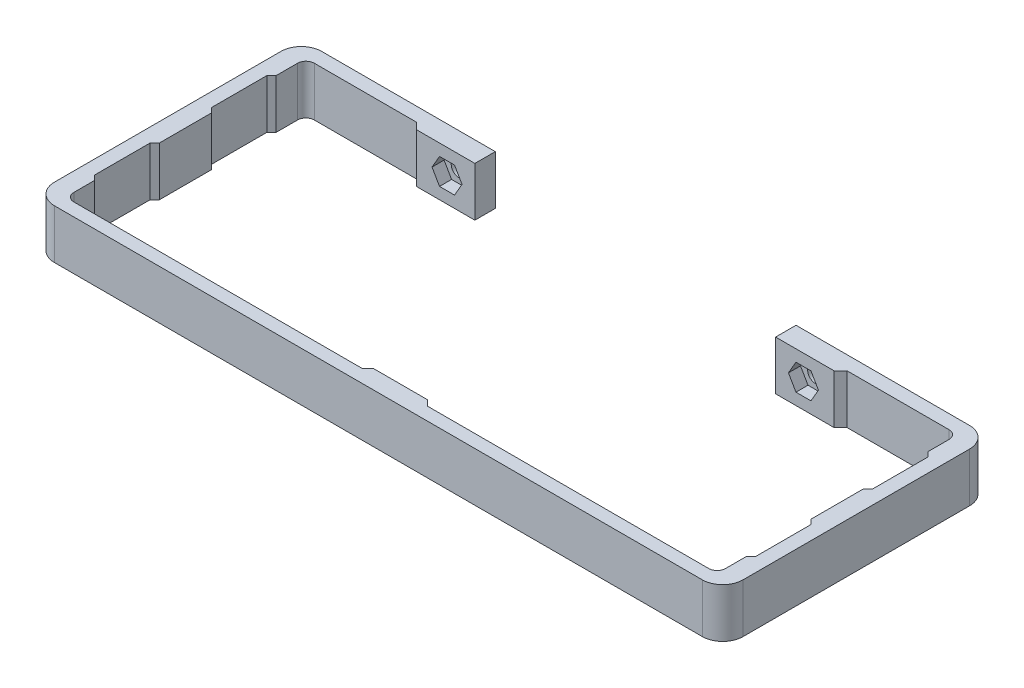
ISO-10303-21;
HEADER;
FILE_DESCRIPTION(('STEP AP214'),'2;1');
FILE_NAME('part.step','',(''),(''),'','','');
FILE_SCHEMA(('AUTOMOTIVE_DESIGN { 1 0 10303 214 1 1 1 1 }'));
ENDSEC;
DATA;
#1=APPLICATION_CONTEXT('core data for automotive mechanical design processes');
#2=APPLICATION_PROTOCOL_DEFINITION('international standard','automotive_design',2000,#1);
#3=PRODUCT_CONTEXT('',#1,'mechanical');
#4=PRODUCT('Part','Part','',(#3));
#5=PRODUCT_RELATED_PRODUCT_CATEGORY('part','',(#4));
#6=PRODUCT_DEFINITION_FORMATION('','',#4);
#7=PRODUCT_DEFINITION_CONTEXT('part definition',#1,'design');
#8=PRODUCT_DEFINITION('design','',#6,#7);
#9=PRODUCT_DEFINITION_SHAPE('','',#8);
#10=(LENGTH_UNIT() NAMED_UNIT(*) SI_UNIT(.MILLI.,.METRE.));
#11=(NAMED_UNIT(*) PLANE_ANGLE_UNIT() SI_UNIT($,.RADIAN.));
#12=(NAMED_UNIT(*) SI_UNIT($,.STERADIAN.) SOLID_ANGLE_UNIT());
#13=UNCERTAINTY_MEASURE_WITH_UNIT(LENGTH_MEASURE(1.E-05),#10,'distance_accuracy_value','');
#14=(GEOMETRIC_REPRESENTATION_CONTEXT(3) GLOBAL_UNCERTAINTY_ASSIGNED_CONTEXT((#13)) GLOBAL_UNIT_ASSIGNED_CONTEXT((#10,
#11,#12)) REPRESENTATION_CONTEXT('',''));
#15=CARTESIAN_POINT('',(0.,0.,0.));
#16=DIRECTION('',(0.,0.,1.));
#17=DIRECTION('',(1.,0.,0.));
#18=AXIS2_PLACEMENT_3D('',#15,#16,#17);
#19=CARTESIAN_POINT('',(117.397379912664,37.2165938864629,-53.6));
#20=DIRECTION('',(1.,0.,0.));
#21=DIRECTION('',(0.,0.,-1.));
#22=AXIS2_PLACEMENT_3D('',#19,#20,#21);
#23=PLANE('',#22);
#24=DIRECTION('',(0.,0.,1.));
#25=VECTOR('',#24,1.);
#26=CARTESIAN_POINT('',(117.397379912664,47.8165938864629,-53.6));
#27=LINE('',#26,#25);
#28=CARTESIAN_POINT('',(117.397379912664,47.8165938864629,-48.8));
#29=VERTEX_POINT('',#28);
#30=CARTESIAN_POINT('',(117.397379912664,47.8165938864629,-44.2));
#31=VERTEX_POINT('',#30);
#32=EDGE_CURVE('E552',#29,#31,#27,.T.);
#33=ORIENTED_EDGE('',*,*,#32,.F.);
#34=DIRECTION('',(0.,1.,0.));
#35=VECTOR('',#34,1.);
#36=CARTESIAN_POINT('',(117.397379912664,37.2165938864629,-48.8));
#37=LINE('',#36,#35);
#38=CARTESIAN_POINT('',(117.397379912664,37.2165938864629,-48.8));
#39=VERTEX_POINT('',#38);
#40=EDGE_CURVE('E758',#29,#39,#37,.F.);
#41=ORIENTED_EDGE('',*,*,#40,.T.);
#42=DIRECTION('',(0.,0.,1.));
#43=VECTOR('',#42,1.);
#44=CARTESIAN_POINT('',(117.397379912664,37.2165938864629,-53.6));
#45=LINE('',#44,#43);
#46=CARTESIAN_POINT('',(117.397379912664,37.2165938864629,-44.2));
#47=VERTEX_POINT('',#46);
#48=EDGE_CURVE('E556',#39,#47,#45,.T.);
#49=ORIENTED_EDGE('',*,*,#48,.T.);
#50=DIRECTION('',(0.,-1.,0.));
#51=VECTOR('',#50,1.);
#52=CARTESIAN_POINT('',(117.397379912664,37.2165938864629,-44.2));
#53=LINE('',#52,#51);
#54=EDGE_CURVE('E657',#47,#31,#53,.F.);
#55=ORIENTED_EDGE('',*,*,#54,.T.);
#56=EDGE_LOOP('',(#33,#41,#49,#55));
#57=FACE_BOUND('',#56,.T.);
#58=ADVANCED_FACE('F33',(#57),#23,.F.);
#59=CARTESIAN_POINT('',(-23.0026200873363,37.2165938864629,-53.6));
#60=DIRECTION('',(-1.,0.,0.));
#61=DIRECTION('',(0.,-1.,0.));
#62=AXIS2_PLACEMENT_3D('',#59,#60,#61);
#63=PLANE('',#62);
#64=DIRECTION('',(0.,0.,1.));
#65=VECTOR('',#64,1.);
#66=CARTESIAN_POINT('',(-23.0026200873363,47.8165938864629,-53.6));
#67=LINE('',#66,#65);
#68=CARTESIAN_POINT('',(-23.0026200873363,47.8165938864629,-5.00000000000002));
#69=VERTEX_POINT('',#68);
#70=CARTESIAN_POINT('',(-23.0026200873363,47.8165938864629,-0.599999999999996));
#71=VERTEX_POINT('',#70);
#72=EDGE_CURVE('E541',#69,#71,#67,.T.);
#73=ORIENTED_EDGE('',*,*,#72,.T.);
#74=DIRECTION('',(0.,1.,0.));
#75=VECTOR('',#74,1.);
#76=CARTESIAN_POINT('',(-23.0026200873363,37.2165938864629,-0.6));
#77=LINE('',#76,#75);
#78=CARTESIAN_POINT('',(-23.0026200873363,37.2165938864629,-0.599999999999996));
#79=VERTEX_POINT('',#78);
#80=EDGE_CURVE('E54',#71,#79,#77,.F.);
#81=ORIENTED_EDGE('',*,*,#80,.T.);
#82=DIRECTION('',(0.,0.,1.));
#83=VECTOR('',#82,1.);
#84=CARTESIAN_POINT('',(-23.0026200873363,37.2165938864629,-53.6));
#85=LINE('',#84,#83);
#86=CARTESIAN_POINT('',(-23.0026200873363,37.2165938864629,-5.00000000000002));
#87=VERTEX_POINT('',#86);
#88=EDGE_CURVE('E538',#87,#79,#85,.T.);
#89=ORIENTED_EDGE('',*,*,#88,.F.);
#90=DIRECTION('',(0.,-1.,0.));
#91=VECTOR('',#90,1.);
#92=CARTESIAN_POINT('',(-23.0026200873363,37.2165938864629,-5.00000000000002));
#93=LINE('',#92,#91);
#94=EDGE_CURVE('E714',#87,#69,#93,.F.);
#95=ORIENTED_EDGE('',*,*,#94,.T.);
#96=EDGE_LOOP('',(#73,#81,#89,#95));
#97=FACE_BOUND('',#96,.T.);
#98=ADVANCED_FACE('F912',(#97),#63,.F.);
#99=CARTESIAN_POINT('',(-23.0026200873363,47.8165938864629,-30.2));
#100=VERTEX_POINT('',#99);
#101=CARTESIAN_POINT('',(-23.0026200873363,47.8165938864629,-19.));
#102=VERTEX_POINT('',#101);
#103=EDGE_CURVE('E546',#100,#102,#67,.T.);
#104=ORIENTED_EDGE('',*,*,#103,.T.);
#105=DIRECTION('',(0.,1.,0.));
#106=VECTOR('',#105,1.);
#107=CARTESIAN_POINT('',(-23.0026200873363,37.2165938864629,-19.));
#108=LINE('',#107,#106);
#109=CARTESIAN_POINT('',(-23.0026200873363,37.2165938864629,-19.));
#110=VERTEX_POINT('',#109);
#111=EDGE_CURVE('E709',#102,#110,#108,.F.);
#112=ORIENTED_EDGE('',*,*,#111,.T.);
#113=CARTESIAN_POINT('',(-23.0026200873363,37.2165938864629,-30.2));
#114=VERTEX_POINT('',#113);
#115=EDGE_CURVE('E542',#114,#110,#85,.T.);
#116=ORIENTED_EDGE('',*,*,#115,.F.);
#117=DIRECTION('',(0.,-1.,0.));
#118=VECTOR('',#117,1.);
#119=CARTESIAN_POINT('',(-23.0026200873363,37.2165938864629,-30.2));
#120=LINE('',#119,#118);
#121=EDGE_CURVE('E722',#114,#100,#120,.F.);
#122=ORIENTED_EDGE('',*,*,#121,.T.);
#123=EDGE_LOOP('',(#104,#112,#116,#122));
#124=FACE_BOUND('',#123,.T.);
#125=ADVANCED_FACE('F901',(#124),#63,.F.);
#126=CARTESIAN_POINT('',(117.397379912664,47.8165938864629,-30.2));
#127=VERTEX_POINT('',#126);
#128=CARTESIAN_POINT('',(117.397379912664,47.8165938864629,-19.));
#129=VERTEX_POINT('',#128);
#130=EDGE_CURVE('E555',#127,#129,#27,.T.);
#131=ORIENTED_EDGE('',*,*,#130,.F.);
#132=DIRECTION('',(0.,1.,0.));
#133=VECTOR('',#132,1.);
#134=CARTESIAN_POINT('',(117.397379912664,37.2165938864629,-30.2));
#135=LINE('',#134,#133);
#136=CARTESIAN_POINT('',(117.397379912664,37.2165938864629,-30.2));
#137=VERTEX_POINT('',#136);
#138=EDGE_CURVE('E684',#127,#137,#135,.F.);
#139=ORIENTED_EDGE('',*,*,#138,.T.);
#140=CARTESIAN_POINT('',(117.397379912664,37.2165938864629,-19.));
#141=VERTEX_POINT('',#140);
#142=EDGE_CURVE('E559',#137,#141,#45,.T.);
#143=ORIENTED_EDGE('',*,*,#142,.T.);
#144=DIRECTION('',(0.,-1.,0.));
#145=VECTOR('',#144,1.);
#146=CARTESIAN_POINT('',(117.397379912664,37.2165938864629,-19.));
#147=LINE('',#146,#145);
#148=EDGE_CURVE('E673',#141,#129,#147,.F.);
#149=ORIENTED_EDGE('',*,*,#148,.T.);
#150=EDGE_LOOP('',(#131,#139,#143,#149));
#151=FACE_BOUND('',#150,.T.);
#152=ADVANCED_FACE('F861',(#151),#23,.F.);
#153=CARTESIAN_POINT('',(85.5973799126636,42.5165938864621,-43.));
#154=DIRECTION('',(0.,0.,-1.));
#155=DIRECTION('',(-1.,0.,0.));
#156=AXIS2_PLACEMENT_3D('',#153,#154,#155);
#157=CYLINDRICAL_SURFACE('',#156,1.70000000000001);
#158=CARTESIAN_POINT('',(85.5973799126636,42.5165938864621,-53.6));
#159=DIRECTION('',(0.,0.,-1.));
#160=DIRECTION('',(-1.,0.,0.));
#161=AXIS2_PLACEMENT_3D('',#158,#159,#160);
#162=CIRCLE('',#161,1.70000000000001);
#163=CARTESIAN_POINT('',(83.8973799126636,42.5165938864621,-53.6));
#164=VERTEX_POINT('',#163);
#165=EDGE_CURVE('E496',#164,#164,#162,.T.);
#166=ORIENTED_EDGE('',*,*,#165,.T.);
#167=EDGE_LOOP('',(#166));
#168=FACE_BOUND('',#167,.T.);
#169=CARTESIAN_POINT('',(85.5973799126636,42.5165938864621,-51.8));
#170=DIRECTION('',(0.,0.,1.));
#171=DIRECTION('',(1.,0.,0.));
#172=AXIS2_PLACEMENT_3D('',#169,#170,#171);
#173=CIRCLE('',#172,1.70000000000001);
#174=CARTESIAN_POINT('',(87.2973799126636,42.5165938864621,-51.8));
#175=VERTEX_POINT('',#174);
#176=EDGE_CURVE('E439',#175,#175,#173,.F.);
#177=ORIENTED_EDGE('',*,*,#176,.F.);
#178=EDGE_LOOP('',(#177));
#179=FACE_BOUND('',#178,.T.);
#180=ADVANCED_FACE('F1263',(#168,#179),#157,.F.);
#181=CARTESIAN_POINT('',(8.79737991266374,42.5165938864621,-43.));
#182=DIRECTION('',(0.,0.,-1.));
#183=DIRECTION('',(-1.,0.,0.));
#184=AXIS2_PLACEMENT_3D('',#181,#182,#183);
#185=CYLINDRICAL_SURFACE('',#184,1.7);
#186=CARTESIAN_POINT('',(8.79737991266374,42.5165938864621,-53.6));
#187=DIRECTION('',(0.,0.,-1.));
#188=DIRECTION('',(-1.,0.,0.));
#189=AXIS2_PLACEMENT_3D('',#186,#187,#188);
#190=CIRCLE('',#189,1.7);
#191=CARTESIAN_POINT('',(7.09737991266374,42.5165938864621,-53.6));
#192=VERTEX_POINT('',#191);
#193=EDGE_CURVE('E499',#192,#192,#190,.T.);
#194=ORIENTED_EDGE('',*,*,#193,.T.);
#195=EDGE_LOOP('',(#194));
#196=FACE_BOUND('',#195,.T.);
#197=CARTESIAN_POINT('',(8.79737991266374,42.5165938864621,-51.8));
#198=DIRECTION('',(0.,0.,1.));
#199=DIRECTION('',(1.,0.,0.));
#200=AXIS2_PLACEMENT_3D('',#197,#198,#199);
#201=CIRCLE('',#200,1.7);
#202=CARTESIAN_POINT('',(10.4973799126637,42.5165938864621,-51.8));
#203=VERTEX_POINT('',#202);
#204=EDGE_CURVE('E485',#203,#203,#201,.F.);
#205=ORIENTED_EDGE('',*,*,#204,.F.);
#206=EDGE_LOOP('',(#205));
#207=FACE_BOUND('',#206,.T.);
#208=ADVANCED_FACE('F946',(#196,#207),#185,.F.);
#209=CARTESIAN_POINT('',(0.,0.,0.));
#210=DIRECTION('',(0.,0.,1.));
#211=DIRECTION('',(1.,0.,0.));
#212=AXIS2_PLACEMENT_3D('',#209,#210,#211);
#213=PLANE('',#212);
#214=DIRECTION('',(1.,0.,0.));
#215=VECTOR('',#214,1.);
#216=CARTESIAN_POINT('',(-27.0026200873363,37.2165938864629,0.));
#217=LINE('',#216,#215);
#218=CARTESIAN_POINT('',(42.1973799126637,37.2165938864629,0.));
#219=VERTEX_POINT('',#218);
#220=CARTESIAN_POINT('',(53.7973799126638,37.2165938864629,0.));
#221=VERTEX_POINT('',#220);
#222=EDGE_CURVE('E558',#219,#221,#217,.T.);
#223=ORIENTED_EDGE('',*,*,#222,.F.);
#224=DIRECTION('',(0.,-1.,0.));
#225=VECTOR('',#224,1.);
#226=CARTESIAN_POINT('',(42.1973799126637,0.,0.));
#227=LINE('',#226,#225);
#228=CARTESIAN_POINT('',(42.1973799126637,47.8165938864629,0.));
#229=VERTEX_POINT('',#228);
#230=EDGE_CURVE('E697',#219,#229,#227,.F.);
#231=ORIENTED_EDGE('',*,*,#230,.T.);
#232=DIRECTION('',(-1.,0.,0.));
#233=VECTOR('',#232,1.);
#234=CARTESIAN_POINT('',(-27.0026200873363,47.8165938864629,0.));
#235=LINE('',#234,#233);
#236=CARTESIAN_POINT('',(53.7973799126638,47.8165938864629,0.));
#237=VERTEX_POINT('',#236);
#238=EDGE_CURVE('E564',#237,#229,#235,.T.);
#239=ORIENTED_EDGE('',*,*,#238,.F.);
#240=DIRECTION('',(0.,1.,0.));
#241=VECTOR('',#240,1.);
#242=CARTESIAN_POINT('',(53.7973799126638,0.,0.));
#243=LINE('',#242,#241);
#244=EDGE_CURVE('E692',#237,#221,#243,.F.);
#245=ORIENTED_EDGE('',*,*,#244,.T.);
#246=EDGE_LOOP('',(#223,#231,#239,#245));
#247=FACE_BOUND('',#246,.T.);
#248=ADVANCED_FACE('F885',(#247),#213,.F.);
#249=CARTESIAN_POINT('',(-27.0026200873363,47.8165938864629,4.));
#250=DIRECTION('',(1.,0.,0.));
#251=DIRECTION('',(0.,1.,0.));
#252=AXIS2_PLACEMENT_3D('',#249,#250,#251);
#253=PLANE('',#252);
#254=DIRECTION('',(0.,0.,-1.));
#255=VECTOR('',#254,1.);
#256=CARTESIAN_POINT('',(-27.0026200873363,47.8165938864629,4.));
#257=LINE('',#256,#255);
#258=CARTESIAN_POINT('',(-27.0026200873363,47.8165938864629,-0.4));
#259=VERTEX_POINT('',#258);
#260=CARTESIAN_POINT('',(-27.0026200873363,47.8165938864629,-49.2));
#261=VERTEX_POINT('',#260);
#262=EDGE_CURVE('E567',#259,#261,#257,.T.);
#263=ORIENTED_EDGE('',*,*,#262,.T.);
#264=DIRECTION('',(0.,1.,0.));
#265=VECTOR('',#264,1.);
#266=CARTESIAN_POINT('',(-27.0026200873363,37.2165938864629,-49.2));
#267=LINE('',#266,#265);
#268=CARTESIAN_POINT('',(-27.0026200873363,37.2165938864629,-49.2));
#269=VERTEX_POINT('',#268);
#270=EDGE_CURVE('E609',#261,#269,#267,.F.);
#271=ORIENTED_EDGE('',*,*,#270,.T.);
#272=DIRECTION('',(0.,0.,-1.));
#273=VECTOR('',#272,1.);
#274=CARTESIAN_POINT('',(-27.0026200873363,37.2165938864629,4.));
#275=LINE('',#274,#273);
#276=CARTESIAN_POINT('',(-27.0026200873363,37.2165938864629,-0.4));
#277=VERTEX_POINT('',#276);
#278=EDGE_CURVE('E578',#277,#269,#275,.T.);
#279=ORIENTED_EDGE('',*,*,#278,.F.);
#280=DIRECTION('',(0.,-1.,0.));
#281=VECTOR('',#280,1.);
#282=CARTESIAN_POINT('',(-27.0026200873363,47.8165938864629,-0.4));
#283=LINE('',#282,#281);
#284=EDGE_CURVE('E607',#277,#259,#283,.F.);
#285=ORIENTED_EDGE('',*,*,#284,.T.);
#286=EDGE_LOOP('',(#263,#271,#279,#285));
#287=FACE_BOUND('',#286,.T.);
#288=ADVANCED_FACE('F945',(#287),#253,.F.);
#289=CARTESIAN_POINT('',(-27.0026200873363,37.2165938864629,4.));
#290=DIRECTION('',(0.,1.,0.));
#291=DIRECTION('',(0.,0.,1.));
#292=AXIS2_PLACEMENT_3D('',#289,#290,#291);
#293=PLANE('',#292);
#294=ORIENTED_EDGE('',*,*,#88,.T.);
#295=CARTESIAN_POINT('',(-21.2026200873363,37.2165938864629,-0.6));
#296=DIRECTION('',(0.,1.,0.));
#297=DIRECTION('',(0.,0.,1.));
#298=AXIS2_PLACEMENT_3D('',#295,#296,#297);
#299=CIRCLE('',#298,1.8);
#300=CARTESIAN_POINT('',(-21.2026200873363,37.2165938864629,1.2));
#301=VERTEX_POINT('',#300);
#302=EDGE_CURVE('E11',#79,#301,#299,.T.);
#303=ORIENTED_EDGE('',*,*,#302,.T.);
#304=DIRECTION('',(1.,0.,0.));
#305=VECTOR('',#304,1.);
#306=CARTESIAN_POINT('',(-27.0026200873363,37.2165938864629,1.2));
#307=LINE('',#306,#305);
#308=CARTESIAN_POINT('',(40.9973799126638,37.2165938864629,1.2));
#309=VERTEX_POINT('',#308);
#310=EDGE_CURVE('E817',#301,#309,#307,.T.);
#311=ORIENTED_EDGE('',*,*,#310,.T.);
#312=DIRECTION('',(-0.707106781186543,0.,0.707106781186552));
#313=VECTOR('',#312,1.);
#314=CARTESIAN_POINT('',(5.59737991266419,37.2165938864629,36.6));
#315=LINE('',#314,#313);
#316=EDGE_CURVE('E703',#309,#219,#315,.F.);
#317=ORIENTED_EDGE('',*,*,#316,.T.);
#318=ORIENTED_EDGE('',*,*,#222,.T.);
#319=DIRECTION('',(-0.707106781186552,0.,-0.707106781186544));
#320=VECTOR('',#319,1.);
#321=CARTESIAN_POINT('',(15.3973799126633,37.2165938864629,-38.4));
#322=LINE('',#321,#320);
#323=CARTESIAN_POINT('',(54.9973799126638,37.2165938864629,1.20000000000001));
#324=VERTEX_POINT('',#323);
#325=EDGE_CURVE('E695',#221,#324,#322,.F.);
#326=ORIENTED_EDGE('',*,*,#325,.T.);
#327=DIRECTION('',(1.,0.,0.));
#328=VECTOR('',#327,1.);
#329=CARTESIAN_POINT('',(-27.0026200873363,37.2165938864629,1.20000000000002));
#330=LINE('',#329,#328);
#331=CARTESIAN_POINT('',(115.597379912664,37.2165938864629,1.2));
#332=VERTEX_POINT('',#331);
#333=EDGE_CURVE('E822',#324,#332,#330,.T.);
#334=ORIENTED_EDGE('',*,*,#333,.T.);
#335=CARTESIAN_POINT('',(115.597379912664,37.2165938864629,-0.599999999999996));
#336=DIRECTION('',(0.,1.,0.));
#337=DIRECTION('',(0.,0.,1.));
#338=AXIS2_PLACEMENT_3D('',#335,#336,#337);
#339=CIRCLE('',#338,1.8);
#340=CARTESIAN_POINT('',(117.397379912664,37.2165938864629,-0.599999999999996));
#341=VERTEX_POINT('',#340);
#342=EDGE_CURVE('E780',#332,#341,#339,.T.);
#343=ORIENTED_EDGE('',*,*,#342,.T.);
#344=CARTESIAN_POINT('',(117.397379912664,37.2165938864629,-5.00000000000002));
#345=VERTEX_POINT('',#344);
#346=EDGE_CURVE('E554',#345,#341,#45,.T.);
#347=ORIENTED_EDGE('',*,*,#346,.F.);
#348=DIRECTION('',(-0.707106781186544,0.,0.707106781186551));
#349=VECTOR('',#348,1.);
#350=CARTESIAN_POINT('',(40.6973799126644,37.2165938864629,71.7));
#351=LINE('',#350,#349);
#352=CARTESIAN_POINT('',(118.397379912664,37.2165938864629,-6.00000000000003));
#353=VERTEX_POINT('',#352);
#354=EDGE_CURVE('E671',#345,#353,#351,.F.);
#355=ORIENTED_EDGE('',*,*,#354,.T.);
#356=DIRECTION('',(0.,0.,-1.));
#357=VECTOR('',#356,1.);
#358=CARTESIAN_POINT('',(118.397379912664,37.2165938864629,4.));
#359=LINE('',#358,#357);
#360=CARTESIAN_POINT('',(118.397379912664,37.2165938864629,-18.));
#361=VERTEX_POINT('',#360);
#362=EDGE_CURVE('E416',#353,#361,#359,.T.);
#363=ORIENTED_EDGE('',*,*,#362,.T.);
#364=DIRECTION('',(0.70710678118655,0.,0.707106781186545));
#365=VECTOR('',#364,1.);
#366=CARTESIAN_POINT('',(56.6973799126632,37.2165938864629,-79.7000000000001));
#367=LINE('',#366,#365);
#368=EDGE_CURVE('E678',#361,#141,#367,.F.);
#369=ORIENTED_EDGE('',*,*,#368,.T.);
#370=ORIENTED_EDGE('',*,*,#142,.F.);
#371=DIRECTION('',(-0.707106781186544,0.,0.707106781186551));
#372=VECTOR('',#371,1.);
#373=CARTESIAN_POINT('',(28.0973799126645,37.2165938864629,59.1000000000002));
#374=LINE('',#373,#372);
#375=CARTESIAN_POINT('',(118.397379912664,37.2165938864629,-31.2));
#376=VERTEX_POINT('',#375);
#377=EDGE_CURVE('E687',#137,#376,#374,.F.);
#378=ORIENTED_EDGE('',*,*,#377,.T.);
#379=DIRECTION('',(0.,0.,-1.));
#380=VECTOR('',#379,1.);
#381=CARTESIAN_POINT('',(118.397379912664,37.2165938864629,4.));
#382=LINE('',#381,#380);
#383=CARTESIAN_POINT('',(118.397379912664,37.2165938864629,-43.2));
#384=VERTEX_POINT('',#383);
#385=EDGE_CURVE('E840',#376,#384,#382,.T.);
#386=ORIENTED_EDGE('',*,*,#385,.T.);
#387=DIRECTION('',(0.70710678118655,0.,0.707106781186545));
#388=VECTOR('',#387,1.);
#389=CARTESIAN_POINT('',(69.2973799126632,37.2165938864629,-92.3000000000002));
#390=LINE('',#389,#388);
#391=EDGE_CURVE('E662',#384,#47,#390,.F.);
#392=ORIENTED_EDGE('',*,*,#391,.T.);
#393=ORIENTED_EDGE('',*,*,#48,.F.);
#394=CARTESIAN_POINT('',(115.597379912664,37.2165938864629,-48.8));
#395=DIRECTION('',(0.,1.,0.));
#396=DIRECTION('',(0.,0.,1.));
#397=AXIS2_PLACEMENT_3D('',#394,#395,#396);
#398=CIRCLE('',#397,1.8);
#399=CARTESIAN_POINT('',(115.597379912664,37.2165938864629,-50.6));
#400=VERTEX_POINT('',#399);
#401=EDGE_CURVE('E776',#39,#400,#398,.T.);
#402=ORIENTED_EDGE('',*,*,#401,.T.);
#403=DIRECTION('',(-1.,0.,0.));
#404=VECTOR('',#403,1.);
#405=CARTESIAN_POINT('',(-27.0026200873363,37.2165938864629,-50.6));
#406=LINE('',#405,#404);
#407=CARTESIAN_POINT('',(93.5973799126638,37.2165938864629,-50.6));
#408=VERTEX_POINT('',#407);
#409=EDGE_CURVE('E815',#400,#408,#406,.T.);
#410=ORIENTED_EDGE('',*,*,#409,.T.);
#411=DIRECTION('',(0.707106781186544,0.,-0.707106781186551));
#412=VECTOR('',#411,1.);
#413=CARTESIAN_POINT('',(5.99737991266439,37.2165938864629,37.0000000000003));
#414=LINE('',#413,#412);
#415=CARTESIAN_POINT('',(92.1973799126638,37.2165938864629,-49.2));
#416=VERTEX_POINT('',#415);
#417=EDGE_CURVE('E744',#408,#416,#414,.F.);
#418=ORIENTED_EDGE('',*,*,#417,.T.);
#419=DIRECTION('',(1.,0.,0.));
#420=VECTOR('',#419,1.);
#421=CARTESIAN_POINT('',(117.397379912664,37.2165938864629,-49.2));
#422=LINE('',#421,#420);
#423=CARTESIAN_POINT('',(79.5973799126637,37.2165938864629,-49.2));
#424=VERTEX_POINT('',#423);
#425=EDGE_CURVE('E506',#424,#416,#422,.T.);
#426=ORIENTED_EDGE('',*,*,#425,.F.);
#427=DIRECTION('',(0.,0.,1.));
#428=VECTOR('',#427,1.);
#429=CARTESIAN_POINT('',(79.5973799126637,37.2165938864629,-53.6));
#430=LINE('',#429,#428);
#431=CARTESIAN_POINT('',(79.5973799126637,37.2165938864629,-53.6));
#432=VERTEX_POINT('',#431);
#433=EDGE_CURVE('E503',#432,#424,#430,.T.);
#434=ORIENTED_EDGE('',*,*,#433,.F.);
#435=DIRECTION('',(-1.,0.,0.));
#436=VECTOR('',#435,1.);
#437=CARTESIAN_POINT('',(121.397379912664,37.2165938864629,-53.6));
#438=LINE('',#437,#436);
#439=CARTESIAN_POINT('',(116.997379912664,37.2165938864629,-53.6));
#440=VERTEX_POINT('',#439);
#441=EDGE_CURVE('E545',#440,#432,#438,.T.);
#442=ORIENTED_EDGE('',*,*,#441,.F.);
#443=CARTESIAN_POINT('',(116.997379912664,37.2165938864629,-49.2));
#444=DIRECTION('',(0.,1.,0.));
#445=DIRECTION('',(0.,0.,1.));
#446=AXIS2_PLACEMENT_3D('',#443,#444,#445);
#447=CIRCLE('',#446,4.4);
#448=CARTESIAN_POINT('',(121.397379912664,37.2165938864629,-49.2));
#449=VERTEX_POINT('',#448);
#450=EDGE_CURVE('E590',#440,#449,#447,.F.);
#451=ORIENTED_EDGE('',*,*,#450,.T.);
#452=DIRECTION('',(0.,0.,-1.));
#453=VECTOR('',#452,1.);
#454=CARTESIAN_POINT('',(121.397379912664,37.2165938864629,4.));
#455=LINE('',#454,#453);
#456=CARTESIAN_POINT('',(121.397379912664,37.2165938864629,-0.4));
#457=VERTEX_POINT('',#456);
#458=EDGE_CURVE('E575',#457,#449,#455,.T.);
#459=ORIENTED_EDGE('',*,*,#458,.F.);
#460=CARTESIAN_POINT('',(116.997379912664,37.2165938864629,-0.4));
#461=DIRECTION('',(0.,1.,0.));
#462=DIRECTION('',(0.,0.,1.));
#463=AXIS2_PLACEMENT_3D('',#460,#461,#462);
#464=CIRCLE('',#463,4.4);
#465=CARTESIAN_POINT('',(116.997379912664,37.2165938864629,4.));
#466=VERTEX_POINT('',#465);
#467=EDGE_CURVE('E584',#457,#466,#464,.F.);
#468=ORIENTED_EDGE('',*,*,#467,.T.);
#469=DIRECTION('',(1.,0.,0.));
#470=VECTOR('',#469,1.);
#471=CARTESIAN_POINT('',(-27.0026200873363,37.2165938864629,4.));
#472=LINE('',#471,#470);
#473=CARTESIAN_POINT('',(-22.6026200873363,37.2165938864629,4.));
#474=VERTEX_POINT('',#473);
#475=EDGE_CURVE('E560',#474,#466,#472,.T.);
#476=ORIENTED_EDGE('',*,*,#475,.F.);
#477=CARTESIAN_POINT('',(-22.6026200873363,37.2165938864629,-0.4));
#478=DIRECTION('',(0.,1.,0.));
#479=DIRECTION('',(0.,0.,1.));
#480=AXIS2_PLACEMENT_3D('',#477,#478,#479);
#481=CIRCLE('',#480,4.4);
#482=EDGE_CURVE('E586',#474,#277,#481,.F.);
#483=ORIENTED_EDGE('',*,*,#482,.T.);
#484=ORIENTED_EDGE('',*,*,#278,.T.);
#485=CARTESIAN_POINT('',(-22.6026200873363,37.2165938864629,-49.2));
#486=DIRECTION('',(0.,1.,0.));
#487=DIRECTION('',(0.,0.,1.));
#488=AXIS2_PLACEMENT_3D('',#485,#486,#487);
#489=CIRCLE('',#488,4.4);
#490=CARTESIAN_POINT('',(-22.6026200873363,37.2165938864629,-53.6));
#491=VERTEX_POINT('',#490);
#492=EDGE_CURVE('E588',#269,#491,#489,.F.);
#493=ORIENTED_EDGE('',*,*,#492,.T.);
#494=DIRECTION('',(-1.,0.,0.));
#495=VECTOR('',#494,1.);
#496=CARTESIAN_POINT('',(-27.0026200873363,37.2165938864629,-53.6));
#497=LINE('',#496,#495);
#498=CARTESIAN_POINT('',(14.7973799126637,37.2165938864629,-53.6));
#499=VERTEX_POINT('',#498);
#500=EDGE_CURVE('E535',#499,#491,#497,.T.);
#501=ORIENTED_EDGE('',*,*,#500,.F.);
#502=DIRECTION('',(0.,0.,-1.));
#503=VECTOR('',#502,1.);
#504=CARTESIAN_POINT('',(14.7973799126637,37.2165938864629,-53.6));
#505=LINE('',#504,#503);
#506=CARTESIAN_POINT('',(14.7973799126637,37.2165938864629,-49.2));
#507=VERTEX_POINT('',#506);
#508=EDGE_CURVE('E520',#507,#499,#505,.T.);
#509=ORIENTED_EDGE('',*,*,#508,.F.);
#510=DIRECTION('',(1.,0.,0.));
#511=VECTOR('',#510,1.);
#512=CARTESIAN_POINT('',(-23.0026200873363,37.2165938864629,-49.2));
#513=LINE('',#512,#511);
#514=CARTESIAN_POINT('',(2.19737991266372,37.2165938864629,-49.2));
#515=VERTEX_POINT('',#514);
#516=EDGE_CURVE('E518',#515,#507,#513,.T.);
#517=ORIENTED_EDGE('',*,*,#516,.F.);
#518=DIRECTION('',(0.707106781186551,0.,0.707106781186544));
#519=VECTOR('',#518,1.);
#520=CARTESIAN_POINT('',(14.1973799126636,37.2165938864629,-37.2000000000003));
#521=LINE('',#520,#519);
#522=CARTESIAN_POINT('',(0.797379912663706,37.2165938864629,-50.6));
#523=VERTEX_POINT('',#522);
#524=EDGE_CURVE('E753',#515,#523,#521,.F.);
#525=ORIENTED_EDGE('',*,*,#524,.T.);
#526=DIRECTION('',(-1.,0.,0.));
#527=VECTOR('',#526,1.);
#528=CARTESIAN_POINT('',(-27.0026200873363,37.2165938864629,-50.6));
#529=LINE('',#528,#527);
#530=CARTESIAN_POINT('',(-21.2026200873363,37.2165938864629,-50.6));
#531=VERTEX_POINT('',#530);
#532=EDGE_CURVE('E791',#523,#531,#529,.T.);
#533=ORIENTED_EDGE('',*,*,#532,.T.);
#534=CARTESIAN_POINT('',(-21.2026200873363,37.2165938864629,-48.8));
#535=DIRECTION('',(0.,1.,0.));
#536=DIRECTION('',(0.,0.,1.));
#537=AXIS2_PLACEMENT_3D('',#534,#535,#536);
#538=CIRCLE('',#537,1.8);
#539=CARTESIAN_POINT('',(-23.0026200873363,37.2165938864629,-48.8));
#540=VERTEX_POINT('',#539);
#541=EDGE_CURVE('E784',#531,#540,#538,.T.);
#542=ORIENTED_EDGE('',*,*,#541,.T.);
#543=CARTESIAN_POINT('',(-23.0026200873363,37.2165938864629,-44.2));
#544=VERTEX_POINT('',#543);
#545=EDGE_CURVE('E539',#540,#544,#85,.T.);
#546=ORIENTED_EDGE('',*,*,#545,.T.);
#547=DIRECTION('',(0.707106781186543,0.,-0.707106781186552));
#548=VECTOR('',#547,1.);
#549=CARTESIAN_POINT('',(-49.1026200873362,37.2165938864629,-18.0999999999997));
#550=LINE('',#549,#548);
#551=CARTESIAN_POINT('',(-24.0026200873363,37.2165938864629,-43.2));
#552=VERTEX_POINT('',#551);
#553=EDGE_CURVE('E736',#544,#552,#550,.F.);
#554=ORIENTED_EDGE('',*,*,#553,.T.);
#555=DIRECTION('',(0.,0.,1.));
#556=VECTOR('',#555,1.);
#557=CARTESIAN_POINT('',(-24.0026200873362,37.2165938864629,4.));
#558=LINE('',#557,#556);
#559=CARTESIAN_POINT('',(-24.0026200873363,37.2165938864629,-31.2));
#560=VERTEX_POINT('',#559);
#561=EDGE_CURVE('E829',#552,#560,#558,.T.);
#562=ORIENTED_EDGE('',*,*,#561,.T.);
#563=DIRECTION('',(-0.707106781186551,0.,-0.707106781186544));
#564=VECTOR('',#563,1.);
#565=CARTESIAN_POINT('',(-7.90262008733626,37.2165938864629,-15.1000000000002));
#566=LINE('',#565,#564);
#567=EDGE_CURVE('E727',#560,#114,#566,.F.);
#568=ORIENTED_EDGE('',*,*,#567,.T.);
#569=ORIENTED_EDGE('',*,*,#115,.T.);
#570=DIRECTION('',(0.707106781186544,0.,-0.707106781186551));
#571=VECTOR('',#570,1.);
#572=CARTESIAN_POINT('',(-36.5026200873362,37.2165938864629,-5.49999999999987));
#573=LINE('',#572,#571);
#574=CARTESIAN_POINT('',(-24.0026200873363,37.2165938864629,-18.));
#575=VERTEX_POINT('',#574);
#576=EDGE_CURVE('E712',#110,#575,#573,.F.);
#577=ORIENTED_EDGE('',*,*,#576,.T.);
#578=DIRECTION('',(0.,0.,1.));
#579=VECTOR('',#578,1.);
#580=CARTESIAN_POINT('',(-24.0026200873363,37.2165938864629,4.));
#581=LINE('',#580,#579);
#582=CARTESIAN_POINT('',(-24.0026200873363,37.2165938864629,-6.00000000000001));
#583=VERTEX_POINT('',#582);
#584=EDGE_CURVE('E837',#575,#583,#581,.T.);
#585=ORIENTED_EDGE('',*,*,#584,.T.);
#586=DIRECTION('',(-0.707106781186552,0.,-0.707106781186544));
#587=VECTOR('',#586,1.);
#588=CARTESIAN_POINT('',(-20.5026200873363,37.2165938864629,-2.50000000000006));
#589=LINE('',#588,#587);
#590=EDGE_CURVE('E719',#583,#87,#589,.F.);
#591=ORIENTED_EDGE('',*,*,#590,.T.);
#592=EDGE_LOOP('',(#294,#303,#311,#317,#318,#326,#334,#343,#347,#355,#363,#369,#370,#378,#386,
#392,#393,#402,#410,#418,#426,#434,#442,#451,#459,#468,#476,#483,#484,#493,#501,#509,#517,#525,
#533,#542,#546,#554,#562,#568,#569,#577,#585,#591));
#593=FACE_BOUND('',#592,.T.);
#594=ADVANCED_FACE('F789',(#593),#293,.F.);
#595=CARTESIAN_POINT('',(121.397379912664,47.8165938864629,4.));
#596=DIRECTION('',(-1.,0.,0.));
#597=DIRECTION('',(0.,0.,1.));
#598=AXIS2_PLACEMENT_3D('',#595,#596,#597);
#599=PLANE('',#598);
#600=ORIENTED_EDGE('',*,*,#458,.T.);
#601=DIRECTION('',(0.,-1.,0.));
#602=VECTOR('',#601,1.);
#603=CARTESIAN_POINT('',(121.397379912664,47.8165938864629,-49.2));
#604=LINE('',#603,#602);
#605=CARTESIAN_POINT('',(121.397379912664,47.8165938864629,-49.2));
#606=VERTEX_POINT('',#605);
#607=EDGE_CURVE('E594',#449,#606,#604,.F.);
#608=ORIENTED_EDGE('',*,*,#607,.T.);
#609=DIRECTION('',(0.,0.,-1.));
#610=VECTOR('',#609,1.);
#611=CARTESIAN_POINT('',(121.397379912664,47.8165938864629,4.));
#612=LINE('',#611,#610);
#613=CARTESIAN_POINT('',(121.397379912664,47.8165938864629,-0.4));
#614=VERTEX_POINT('',#613);
#615=EDGE_CURVE('E572',#614,#606,#612,.T.);
#616=ORIENTED_EDGE('',*,*,#615,.F.);
#617=DIRECTION('',(0.,1.,0.));
#618=VECTOR('',#617,1.);
#619=CARTESIAN_POINT('',(121.397379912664,37.2165938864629,-0.4));
#620=LINE('',#619,#618);
#621=EDGE_CURVE('E592',#614,#457,#620,.F.);
#622=ORIENTED_EDGE('',*,*,#621,.T.);
#623=EDGE_LOOP('',(#600,#608,#616,#622));
#624=FACE_BOUND('',#623,.T.);
#625=ADVANCED_FACE('F949',(#624),#599,.F.);
#626=CARTESIAN_POINT('',(-27.0026200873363,47.8165938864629,4.));
#627=DIRECTION('',(0.,-1.,0.));
#628=DIRECTION('',(0.,0.,-1.));
#629=AXIS2_PLACEMENT_3D('',#626,#627,#628);
#630=PLANE('',#629);
#631=DIRECTION('',(1.,0.,0.));
#632=VECTOR('',#631,1.);
#633=CARTESIAN_POINT('',(-23.0026200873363,47.8165938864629,1.2));
#634=LINE('',#633,#632);
#635=CARTESIAN_POINT('',(-21.2026200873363,47.8165938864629,1.2));
#636=VERTEX_POINT('',#635);
#637=CARTESIAN_POINT('',(40.9973799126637,47.8165938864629,1.2));
#638=VERTEX_POINT('',#637);
#639=EDGE_CURVE('E810',#636,#638,#634,.T.);
#640=ORIENTED_EDGE('',*,*,#639,.F.);
#641=CARTESIAN_POINT('',(-21.2026200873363,47.8165938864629,-0.6));
#642=DIRECTION('',(0.,-1.,0.));
#643=DIRECTION('',(0.,0.,-1.));
#644=AXIS2_PLACEMENT_3D('',#641,#642,#643);
#645=CIRCLE('',#644,1.8);
#646=EDGE_CURVE('E41',#636,#71,#645,.T.);
#647=ORIENTED_EDGE('',*,*,#646,.T.);
#648=ORIENTED_EDGE('',*,*,#72,.F.);
#649=DIRECTION('',(0.707106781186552,0.,0.707106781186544));
#650=VECTOR('',#649,1.);
#651=CARTESIAN_POINT('',(-20.5026200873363,47.8165938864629,-2.50000000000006));
#652=LINE('',#651,#650);
#653=CARTESIAN_POINT('',(-24.0026200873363,47.8165938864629,-6.00000000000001));
#654=VERTEX_POINT('',#653);
#655=EDGE_CURVE('E717',#69,#654,#652,.F.);
#656=ORIENTED_EDGE('',*,*,#655,.T.);
#657=DIRECTION('',(0.,0.,1.));
#658=VECTOR('',#657,1.);
#659=CARTESIAN_POINT('',(-24.0026200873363,47.8165938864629,-4.));
#660=LINE('',#659,#658);
#661=CARTESIAN_POINT('',(-24.0026200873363,47.8165938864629,-18.));
#662=VERTEX_POINT('',#661);
#663=EDGE_CURVE('E830',#662,#654,#660,.T.);
#664=ORIENTED_EDGE('',*,*,#663,.F.);
#665=DIRECTION('',(-0.707106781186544,0.,0.707106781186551));
#666=VECTOR('',#665,1.);
#667=CARTESIAN_POINT('',(-36.5026200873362,47.8165938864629,-5.49999999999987));
#668=LINE('',#667,#666);
#669=EDGE_CURVE('E706',#662,#102,#668,.F.);
#670=ORIENTED_EDGE('',*,*,#669,.T.);
#671=ORIENTED_EDGE('',*,*,#103,.F.);
#672=DIRECTION('',(0.707106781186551,0.,0.707106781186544));
#673=VECTOR('',#672,1.);
#674=CARTESIAN_POINT('',(-7.90262008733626,47.8165938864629,-15.1000000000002));
#675=LINE('',#674,#673);
#676=CARTESIAN_POINT('',(-24.0026200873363,47.8165938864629,-31.2));
#677=VERTEX_POINT('',#676);
#678=EDGE_CURVE('E725',#100,#677,#675,.F.);
#679=ORIENTED_EDGE('',*,*,#678,.T.);
#680=DIRECTION('',(0.,0.,1.));
#681=VECTOR('',#680,1.);
#682=CARTESIAN_POINT('',(-24.0026200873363,47.8165938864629,-45.2));
#683=LINE('',#682,#681);
#684=CARTESIAN_POINT('',(-24.0026200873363,47.8165938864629,-43.2));
#685=VERTEX_POINT('',#684);
#686=EDGE_CURVE('E825',#685,#677,#683,.T.);
#687=ORIENTED_EDGE('',*,*,#686,.F.);
#688=DIRECTION('',(-0.707106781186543,0.,0.707106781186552));
#689=VECTOR('',#688,1.);
#690=CARTESIAN_POINT('',(-49.1026200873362,47.8165938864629,-18.0999999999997));
#691=LINE('',#690,#689);
#692=CARTESIAN_POINT('',(-23.0026200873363,47.8165938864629,-44.2));
#693=VERTEX_POINT('',#692);
#694=EDGE_CURVE('E730',#685,#693,#691,.F.);
#695=ORIENTED_EDGE('',*,*,#694,.T.);
#696=CARTESIAN_POINT('',(-23.0026200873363,47.8165938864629,-48.8));
#697=VERTEX_POINT('',#696);
#698=EDGE_CURVE('E543',#697,#693,#67,.T.);
#699=ORIENTED_EDGE('',*,*,#698,.F.);
#700=CARTESIAN_POINT('',(-21.2026200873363,47.8165938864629,-48.8));
#701=DIRECTION('',(0.,-1.,0.));
#702=DIRECTION('',(0.,0.,-1.));
#703=AXIS2_PLACEMENT_3D('',#700,#701,#702);
#704=CIRCLE('',#703,1.8);
#705=CARTESIAN_POINT('',(-21.2026200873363,47.8165938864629,-50.6));
#706=VERTEX_POINT('',#705);
#707=EDGE_CURVE('E782',#697,#706,#704,.T.);
#708=ORIENTED_EDGE('',*,*,#707,.T.);
#709=DIRECTION('',(-1.,0.,0.));
#710=VECTOR('',#709,1.);
#711=CARTESIAN_POINT('',(-23.0026200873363,47.8165938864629,-50.6));
#712=LINE('',#711,#710);
#713=CARTESIAN_POINT('',(0.797379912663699,47.8165938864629,-50.6));
#714=VERTEX_POINT('',#713);
#715=EDGE_CURVE('E804',#714,#706,#712,.T.);
#716=ORIENTED_EDGE('',*,*,#715,.F.);
#717=DIRECTION('',(-0.707106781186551,0.,-0.707106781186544));
#718=VECTOR('',#717,1.);
#719=CARTESIAN_POINT('',(14.1973799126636,47.8165938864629,-37.2000000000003));
#720=LINE('',#719,#718);
#721=CARTESIAN_POINT('',(2.19737991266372,47.8165938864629,-49.2));
#722=VERTEX_POINT('',#721);
#723=EDGE_CURVE('E747',#714,#722,#720,.F.);
#724=ORIENTED_EDGE('',*,*,#723,.T.);
#725=DIRECTION('',(1.,0.,0.));
#726=VECTOR('',#725,1.);
#727=CARTESIAN_POINT('',(-23.0026200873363,47.8165938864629,-49.2));
#728=LINE('',#727,#726);
#729=CARTESIAN_POINT('',(14.7973799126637,47.8165938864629,-49.2));
#730=VERTEX_POINT('',#729);
#731=EDGE_CURVE('E515',#722,#730,#728,.T.);
#732=ORIENTED_EDGE('',*,*,#731,.T.);
#733=DIRECTION('',(0.,0.,-1.));
#734=VECTOR('',#733,1.);
#735=CARTESIAN_POINT('',(14.7973799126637,47.8165938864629,-53.6));
#736=LINE('',#735,#734);
#737=CARTESIAN_POINT('',(14.7973799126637,47.8165938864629,-53.6));
#738=VERTEX_POINT('',#737);
#739=EDGE_CURVE('E521',#730,#738,#736,.T.);
#740=ORIENTED_EDGE('',*,*,#739,.T.);
#741=DIRECTION('',(1.,0.,0.));
#742=VECTOR('',#741,1.);
#743=CARTESIAN_POINT('',(-27.0026200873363,47.8165938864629,-53.6));
#744=LINE('',#743,#742);
#745=CARTESIAN_POINT('',(-22.6026200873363,47.8165938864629,-53.6));
#746=VERTEX_POINT('',#745);
#747=EDGE_CURVE('E531',#746,#738,#744,.T.);
#748=ORIENTED_EDGE('',*,*,#747,.F.);
#749=CARTESIAN_POINT('',(-22.6026200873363,47.8165938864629,-49.2));
#750=DIRECTION('',(0.,-1.,0.));
#751=DIRECTION('',(0.,0.,-1.));
#752=AXIS2_PLACEMENT_3D('',#749,#750,#751);
#753=CIRCLE('',#752,4.4);
#754=EDGE_CURVE('E600',#746,#261,#753,.F.);
#755=ORIENTED_EDGE('',*,*,#754,.T.);
#756=ORIENTED_EDGE('',*,*,#262,.F.);
#757=CARTESIAN_POINT('',(-22.6026200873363,47.8165938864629,-0.4));
#758=DIRECTION('',(0.,-1.,0.));
#759=DIRECTION('',(0.,0.,-1.));
#760=AXIS2_PLACEMENT_3D('',#757,#758,#759);
#761=CIRCLE('',#760,4.4);
#762=CARTESIAN_POINT('',(-22.6026200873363,47.8165938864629,4.));
#763=VERTEX_POINT('',#762);
#764=EDGE_CURVE('E598',#259,#763,#761,.F.);
#765=ORIENTED_EDGE('',*,*,#764,.T.);
#766=DIRECTION('',(-1.,0.,0.));
#767=VECTOR('',#766,1.);
#768=CARTESIAN_POINT('',(-27.0026200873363,47.8165938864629,4.));
#769=LINE('',#768,#767);
#770=CARTESIAN_POINT('',(116.997379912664,47.8165938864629,4.));
#771=VERTEX_POINT('',#770);
#772=EDGE_CURVE('E563',#771,#763,#769,.T.);
#773=ORIENTED_EDGE('',*,*,#772,.F.);
#774=CARTESIAN_POINT('',(116.997379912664,47.8165938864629,-0.4));
#775=DIRECTION('',(0.,-1.,0.));
#776=DIRECTION('',(0.,0.,-1.));
#777=AXIS2_PLACEMENT_3D('',#774,#775,#776);
#778=CIRCLE('',#777,4.4);
#779=EDGE_CURVE('E596',#771,#614,#778,.F.);
#780=ORIENTED_EDGE('',*,*,#779,.T.);
#781=ORIENTED_EDGE('',*,*,#615,.T.);
#782=CARTESIAN_POINT('',(116.997379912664,47.8165938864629,-49.2));
#783=DIRECTION('',(0.,-1.,0.));
#784=DIRECTION('',(0.,0.,-1.));
#785=AXIS2_PLACEMENT_3D('',#782,#783,#784);
#786=CIRCLE('',#785,4.4);
#787=CARTESIAN_POINT('',(116.997379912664,47.8165938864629,-53.6));
#788=VERTEX_POINT('',#787);
#789=EDGE_CURVE('E602',#606,#788,#786,.F.);
#790=ORIENTED_EDGE('',*,*,#789,.T.);
#791=DIRECTION('',(1.,0.,0.));
#792=VECTOR('',#791,1.);
#793=CARTESIAN_POINT('',(121.397379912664,47.8165938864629,-53.6));
#794=LINE('',#793,#792);
#795=CARTESIAN_POINT('',(79.5973799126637,47.8165938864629,-53.6));
#796=VERTEX_POINT('',#795);
#797=EDGE_CURVE('E548',#796,#788,#794,.T.);
#798=ORIENTED_EDGE('',*,*,#797,.F.);
#799=DIRECTION('',(0.,0.,1.));
#800=VECTOR('',#799,1.);
#801=CARTESIAN_POINT('',(79.5973799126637,47.8165938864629,-53.6));
#802=LINE('',#801,#800);
#803=CARTESIAN_POINT('',(79.5973799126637,47.8165938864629,-49.2));
#804=VERTEX_POINT('',#803);
#805=EDGE_CURVE('E502',#796,#804,#802,.T.);
#806=ORIENTED_EDGE('',*,*,#805,.T.);
#807=DIRECTION('',(1.,0.,0.));
#808=VECTOR('',#807,1.);
#809=CARTESIAN_POINT('',(117.397379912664,47.8165938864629,-49.2));
#810=LINE('',#809,#808);
#811=CARTESIAN_POINT('',(92.1973799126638,47.8165938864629,-49.2));
#812=VERTEX_POINT('',#811);
#813=EDGE_CURVE('E507',#804,#812,#810,.T.);
#814=ORIENTED_EDGE('',*,*,#813,.T.);
#815=DIRECTION('',(-0.707106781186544,0.,0.707106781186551));
#816=VECTOR('',#815,1.);
#817=CARTESIAN_POINT('',(5.99737991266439,47.8165938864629,37.0000000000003));
#818=LINE('',#817,#816);
#819=CARTESIAN_POINT('',(93.5973799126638,47.8165938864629,-50.6));
#820=VERTEX_POINT('',#819);
#821=EDGE_CURVE('E741',#812,#820,#818,.F.);
#822=ORIENTED_EDGE('',*,*,#821,.T.);
#823=DIRECTION('',(-1.,0.,0.));
#824=VECTOR('',#823,1.);
#825=CARTESIAN_POINT('',(117.397379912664,47.8165938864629,-50.6));
#826=LINE('',#825,#824);
#827=CARTESIAN_POINT('',(115.597379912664,47.8165938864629,-50.6));
#828=VERTEX_POINT('',#827);
#829=EDGE_CURVE('E808',#828,#820,#826,.T.);
#830=ORIENTED_EDGE('',*,*,#829,.F.);
#831=CARTESIAN_POINT('',(115.597379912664,47.8165938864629,-48.8));
#832=DIRECTION('',(0.,-1.,0.));
#833=DIRECTION('',(0.,0.,-1.));
#834=AXIS2_PLACEMENT_3D('',#831,#832,#833);
#835=CIRCLE('',#834,1.8);
#836=EDGE_CURVE('E774',#828,#29,#835,.T.);
#837=ORIENTED_EDGE('',*,*,#836,.T.);
#838=ORIENTED_EDGE('',*,*,#32,.T.);
#839=DIRECTION('',(-0.70710678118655,0.,-0.707106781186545));
#840=VECTOR('',#839,1.);
#841=CARTESIAN_POINT('',(69.2973799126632,47.8165938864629,-92.3000000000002));
#842=LINE('',#841,#840);
#843=CARTESIAN_POINT('',(118.397379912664,47.8165938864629,-43.2));
#844=VERTEX_POINT('',#843);
#845=EDGE_CURVE('E660',#31,#844,#842,.F.);
#846=ORIENTED_EDGE('',*,*,#845,.T.);
#847=DIRECTION('',(0.,0.,-1.));
#848=VECTOR('',#847,1.);
#849=CARTESIAN_POINT('',(118.397379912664,47.8165938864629,-45.2));
#850=LINE('',#849,#848);
#851=CARTESIAN_POINT('',(118.397379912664,47.8165938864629,-31.2));
#852=VERTEX_POINT('',#851);
#853=EDGE_CURVE('E826',#852,#844,#850,.T.);
#854=ORIENTED_EDGE('',*,*,#853,.F.);
#855=DIRECTION('',(0.707106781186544,0.,-0.707106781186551));
#856=VECTOR('',#855,1.);
#857=CARTESIAN_POINT('',(28.0973799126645,47.8165938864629,59.1000000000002));
#858=LINE('',#857,#856);
#859=EDGE_CURVE('E681',#852,#127,#858,.F.);
#860=ORIENTED_EDGE('',*,*,#859,.T.);
#861=ORIENTED_EDGE('',*,*,#130,.T.);
#862=DIRECTION('',(-0.70710678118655,0.,-0.707106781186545));
#863=VECTOR('',#862,1.);
#864=CARTESIAN_POINT('',(56.6973799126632,47.8165938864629,-79.7000000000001));
#865=LINE('',#864,#863);
#866=CARTESIAN_POINT('',(118.397379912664,47.8165938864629,-18.));
#867=VERTEX_POINT('',#866);
#868=EDGE_CURVE('E676',#129,#867,#865,.F.);
#869=ORIENTED_EDGE('',*,*,#868,.T.);
#870=DIRECTION('',(0.,0.,-1.));
#871=VECTOR('',#870,1.);
#872=CARTESIAN_POINT('',(118.397379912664,47.8165938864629,-4.));
#873=LINE('',#872,#871);
#874=CARTESIAN_POINT('',(118.397379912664,47.8165938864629,-6.00000000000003));
#875=VERTEX_POINT('',#874);
#876=EDGE_CURVE('E842',#875,#867,#873,.T.);
#877=ORIENTED_EDGE('',*,*,#876,.F.);
#878=DIRECTION('',(0.707106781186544,0.,-0.707106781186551));
#879=VECTOR('',#878,1.);
#880=CARTESIAN_POINT('',(40.6973799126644,47.8165938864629,71.7));
#881=LINE('',#880,#879);
#882=CARTESIAN_POINT('',(117.397379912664,47.8165938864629,-5.00000000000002));
#883=VERTEX_POINT('',#882);
#884=EDGE_CURVE('E665',#875,#883,#881,.F.);
#885=ORIENTED_EDGE('',*,*,#884,.T.);
#886=CARTESIAN_POINT('',(117.397379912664,47.8165938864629,-0.599999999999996));
#887=VERTEX_POINT('',#886);
#888=EDGE_CURVE('E551',#883,#887,#27,.T.);
#889=ORIENTED_EDGE('',*,*,#888,.T.);
#890=CARTESIAN_POINT('',(115.597379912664,47.8165938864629,-0.599999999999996));
#891=DIRECTION('',(0.,-1.,0.));
#892=DIRECTION('',(0.,0.,-1.));
#893=AXIS2_PLACEMENT_3D('',#890,#891,#892);
#894=CIRCLE('',#893,1.8);
#895=CARTESIAN_POINT('',(115.597379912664,47.8165938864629,1.2));
#896=VERTEX_POINT('',#895);
#897=EDGE_CURVE('E778',#887,#896,#894,.T.);
#898=ORIENTED_EDGE('',*,*,#897,.T.);
#899=DIRECTION('',(1.,0.,0.));
#900=VECTOR('',#899,1.);
#901=CARTESIAN_POINT('',(117.397379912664,47.8165938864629,1.2));
#902=LINE('',#901,#900);
#903=CARTESIAN_POINT('',(54.9973799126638,47.8165938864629,1.20000000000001));
#904=VERTEX_POINT('',#903);
#905=EDGE_CURVE('E819',#904,#896,#902,.T.);
#906=ORIENTED_EDGE('',*,*,#905,.F.);
#907=DIRECTION('',(0.707106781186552,0.,0.707106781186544));
#908=VECTOR('',#907,1.);
#909=CARTESIAN_POINT('',(15.3973799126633,47.8165938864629,-38.4));
#910=LINE('',#909,#908);
#911=EDGE_CURVE('E689',#904,#237,#910,.F.);
#912=ORIENTED_EDGE('',*,*,#911,.T.);
#913=ORIENTED_EDGE('',*,*,#238,.T.);
#914=DIRECTION('',(0.707106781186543,0.,-0.707106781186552));
#915=VECTOR('',#914,1.);
#916=CARTESIAN_POINT('',(5.59737991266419,47.8165938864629,36.6));
#917=LINE('',#916,#915);
#918=EDGE_CURVE('E700',#229,#638,#917,.F.);
#919=ORIENTED_EDGE('',*,*,#918,.T.);
#920=EDGE_LOOP('',(#640,#647,#648,#656,#664,#670,#671,#679,#687,#695,#699,#708,#716,#724,#732,
#740,#748,#755,#756,#765,#773,#780,#781,#790,#798,#806,#814,#822,#830,#837,#838,#846,#854,#860,
#861,#869,#877,#885,#889,#898,#906,#912,#913,#919));
#921=FACE_BOUND('',#920,.T.);
#922=ADVANCED_FACE('F803',(#921),#630,.F.);
#923=CARTESIAN_POINT('',(0.,0.,4.));
#924=DIRECTION('',(0.,0.,1.));
#925=DIRECTION('',(1.,0.,0.));
#926=AXIS2_PLACEMENT_3D('',#923,#924,#925);
#927=PLANE('',#926);
#928=ORIENTED_EDGE('',*,*,#772,.T.);
#929=DIRECTION('',(0.,-1.,0.));
#930=VECTOR('',#929,1.);
#931=CARTESIAN_POINT('',(-22.6026200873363,37.2165938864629,4.));
#932=LINE('',#931,#930);
#933=EDGE_CURVE('E614',#763,#474,#932,.T.);
#934=ORIENTED_EDGE('',*,*,#933,.T.);
#935=ORIENTED_EDGE('',*,*,#475,.T.);
#936=DIRECTION('',(0.,1.,0.));
#937=VECTOR('',#936,1.);
#938=CARTESIAN_POINT('',(116.997379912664,47.8165938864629,4.));
#939=LINE('',#938,#937);
#940=EDGE_CURVE('E611',#466,#771,#939,.T.);
#941=ORIENTED_EDGE('',*,*,#940,.T.);
#942=EDGE_LOOP('',(#928,#934,#935,#941));
#943=FACE_BOUND('',#942,.T.);
#944=ADVANCED_FACE('F936',(#943),#927,.T.);
#945=ORIENTED_EDGE('',*,*,#346,.T.);
#946=DIRECTION('',(0.,1.,0.));
#947=VECTOR('',#946,1.);
#948=CARTESIAN_POINT('',(117.397379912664,47.8165938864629,-0.599999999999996));
#949=LINE('',#948,#947);
#950=EDGE_CURVE('E760',#341,#887,#949,.T.);
#951=ORIENTED_EDGE('',*,*,#950,.T.);
#952=ORIENTED_EDGE('',*,*,#888,.F.);
#953=DIRECTION('',(0.,1.,0.));
#954=VECTOR('',#953,1.);
#955=CARTESIAN_POINT('',(117.397379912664,37.2165938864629,-5.00000000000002));
#956=LINE('',#955,#954);
#957=EDGE_CURVE('E668',#883,#345,#956,.F.);
#958=ORIENTED_EDGE('',*,*,#957,.T.);
#959=EDGE_LOOP('',(#945,#951,#952,#958));
#960=FACE_BOUND('',#959,.T.);
#961=ADVANCED_FACE('F867',(#960),#23,.F.);
#962=CARTESIAN_POINT('',(0.,0.,-53.6));
#963=DIRECTION('',(0.,0.,1.));
#964=DIRECTION('',(1.,0.,0.));
#965=AXIS2_PLACEMENT_3D('',#962,#963,#964);
#966=PLANE('',#965);
#967=ORIENTED_EDGE('',*,*,#165,.F.);
#968=EDGE_LOOP('',(#967));
#969=FACE_BOUND('',#968,.T.);
#970=ORIENTED_EDGE('',*,*,#797,.T.);
#971=DIRECTION('',(0.,-1.,0.));
#972=VECTOR('',#971,1.);
#973=CARTESIAN_POINT('',(116.997379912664,0.,-53.6));
#974=LINE('',#973,#972);
#975=EDGE_CURVE('E581',#788,#440,#974,.T.);
#976=ORIENTED_EDGE('',*,*,#975,.T.);
#977=ORIENTED_EDGE('',*,*,#441,.T.);
#978=DIRECTION('',(0.,1.,0.));
#979=VECTOR('',#978,1.);
#980=CARTESIAN_POINT('',(79.5973799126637,37.2165938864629,-53.6));
#981=LINE('',#980,#979);
#982=EDGE_CURVE('E509',#432,#796,#981,.T.);
#983=ORIENTED_EDGE('',*,*,#982,.T.);
#984=EDGE_LOOP('',(#970,#976,#977,#983));
#985=FACE_BOUND('',#984,.T.);
#986=ADVANCED_FACE('F925',(#969,#985),#966,.F.);
#987=ORIENTED_EDGE('',*,*,#545,.F.);
#988=DIRECTION('',(0.,1.,0.));
#989=VECTOR('',#988,1.);
#990=CARTESIAN_POINT('',(-23.0026200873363,47.8165938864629,-48.8));
#991=LINE('',#990,#989);
#992=EDGE_CURVE('E765',#540,#697,#991,.T.);
#993=ORIENTED_EDGE('',*,*,#992,.T.);
#994=ORIENTED_EDGE('',*,*,#698,.T.);
#995=DIRECTION('',(0.,1.,0.));
#996=VECTOR('',#995,1.);
#997=CARTESIAN_POINT('',(-23.0026200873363,37.2165938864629,-44.2));
#998=LINE('',#997,#996);
#999=EDGE_CURVE('E733',#693,#544,#998,.F.);
#1000=ORIENTED_EDGE('',*,*,#999,.T.);
#1001=EDGE_LOOP('',(#987,#993,#994,#1000));
#1002=FACE_BOUND('',#1001,.T.);
#1003=ADVANCED_FACE('F796',(#1002),#63,.F.);
#1004=CARTESIAN_POINT('',(0.,0.,-53.6));
#1005=DIRECTION('',(0.,0.,-1.));
#1006=DIRECTION('',(-1.,0.,0.));
#1007=AXIS2_PLACEMENT_3D('',#1004,#1005,#1006);
#1008=PLANE('',#1007);
#1009=ORIENTED_EDGE('',*,*,#193,.F.);
#1010=EDGE_LOOP('',(#1009));
#1011=FACE_BOUND('',#1010,.T.);
#1012=ORIENTED_EDGE('',*,*,#500,.T.);
#1013=DIRECTION('',(0.,1.,0.));
#1014=VECTOR('',#1013,1.);
#1015=CARTESIAN_POINT('',(-22.6026200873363,47.8165938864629,-53.6));
#1016=LINE('',#1015,#1014);
#1017=EDGE_CURVE('E604',#491,#746,#1016,.T.);
#1018=ORIENTED_EDGE('',*,*,#1017,.T.);
#1019=ORIENTED_EDGE('',*,*,#747,.T.);
#1020=DIRECTION('',(0.,1.,0.));
#1021=VECTOR('',#1020,1.);
#1022=CARTESIAN_POINT('',(14.7973799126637,37.2165938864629,-53.6));
#1023=LINE('',#1022,#1021);
#1024=EDGE_CURVE('E528',#499,#738,#1023,.T.);
#1025=ORIENTED_EDGE('',*,*,#1024,.F.);
#1026=EDGE_LOOP('',(#1012,#1018,#1019,#1025));
#1027=FACE_BOUND('',#1026,.T.);
#1028=ADVANCED_FACE('F924',(#1011,#1027),#1008,.T.);
#1029=CARTESIAN_POINT('',(14.7973799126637,37.2165938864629,-53.6));
#1030=DIRECTION('',(1.,0.,0.));
#1031=DIRECTION('',(0.,0.,-1.));
#1032=AXIS2_PLACEMENT_3D('',#1029,#1030,#1031);
#1033=PLANE('',#1032);
#1034=ORIENTED_EDGE('',*,*,#739,.F.);
#1035=DIRECTION('',(0.,1.,0.));
#1036=VECTOR('',#1035,1.);
#1037=CARTESIAN_POINT('',(14.7973799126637,37.2165938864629,-49.2));
#1038=LINE('',#1037,#1036);
#1039=EDGE_CURVE('E524',#507,#730,#1038,.T.);
#1040=ORIENTED_EDGE('',*,*,#1039,.F.);
#1041=ORIENTED_EDGE('',*,*,#508,.T.);
#1042=ORIENTED_EDGE('',*,*,#1024,.T.);
#1043=EDGE_LOOP('',(#1034,#1040,#1041,#1042));
#1044=FACE_BOUND('',#1043,.T.);
#1045=ADVANCED_FACE('F930',(#1044),#1033,.T.);
#1046=CARTESIAN_POINT('',(-23.0026200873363,37.2165938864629,-49.2));
#1047=DIRECTION('',(0.,0.,1.));
#1048=DIRECTION('',(1.,0.,0.));
#1049=AXIS2_PLACEMENT_3D('',#1046,#1047,#1048);
#1050=PLANE('',#1049);
#1051=ORIENTED_EDGE('',*,*,#731,.F.);
#1052=DIRECTION('',(0.,1.,0.));
#1053=VECTOR('',#1052,1.);
#1054=CARTESIAN_POINT('',(2.19737991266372,34.2165938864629,-49.2));
#1055=LINE('',#1054,#1053);
#1056=EDGE_CURVE('E750',#722,#515,#1055,.F.);
#1057=ORIENTED_EDGE('',*,*,#1056,.T.);
#1058=ORIENTED_EDGE('',*,*,#516,.T.);
#1059=ORIENTED_EDGE('',*,*,#1039,.T.);
#1060=EDGE_LOOP('',(#1051,#1057,#1058,#1059));
#1061=FACE_BOUND('',#1060,.T.);
#1062=DIRECTION('',(1.,0.,0.));
#1063=VECTOR('',#1062,1.);
#1064=CARTESIAN_POINT('',(7.18079915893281,39.7165938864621,-49.2));
#1065=LINE('',#1064,#1063);
#1066=CARTESIAN_POINT('',(7.18079915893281,39.7165938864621,-49.2));
#1067=VERTEX_POINT('',#1066);
#1068=CARTESIAN_POINT('',(10.4139606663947,39.7165938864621,-49.2));
#1069=VERTEX_POINT('',#1068);
#1070=EDGE_CURVE('E467',#1067,#1069,#1065,.T.);
#1071=ORIENTED_EDGE('',*,*,#1070,.F.);
#1072=DIRECTION('',(0.5,-0.866025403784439,0.));
#1073=VECTOR('',#1072,1.);
#1074=CARTESIAN_POINT('',(5.56421840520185,42.5165938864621,-49.2));
#1075=LINE('',#1074,#1073);
#1076=CARTESIAN_POINT('',(5.56421840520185,42.5165938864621,-49.2));
#1077=VERTEX_POINT('',#1076);
#1078=EDGE_CURVE('E451',#1077,#1067,#1075,.T.);
#1079=ORIENTED_EDGE('',*,*,#1078,.F.);
#1080=DIRECTION('',(-0.5,-0.866025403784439,0.));
#1081=VECTOR('',#1080,1.);
#1082=CARTESIAN_POINT('',(7.1807991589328,45.3165938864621,-49.2));
#1083=LINE('',#1082,#1081);
#1084=CARTESIAN_POINT('',(7.1807991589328,45.3165938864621,-49.2));
#1085=VERTEX_POINT('',#1084);
#1086=EDGE_CURVE('E478',#1085,#1077,#1083,.T.);
#1087=ORIENTED_EDGE('',*,*,#1086,.F.);
#1088=DIRECTION('',(-1.,0.,0.));
#1089=VECTOR('',#1088,1.);
#1090=CARTESIAN_POINT('',(10.4139606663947,45.3165938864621,-49.2));
#1091=LINE('',#1090,#1089);
#1092=CARTESIAN_POINT('',(10.4139606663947,45.3165938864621,-49.2));
#1093=VERTEX_POINT('',#1092);
#1094=EDGE_CURVE('E475',#1093,#1085,#1091,.T.);
#1095=ORIENTED_EDGE('',*,*,#1094,.F.);
#1096=DIRECTION('',(-0.5,0.866025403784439,0.));
#1097=VECTOR('',#1096,1.);
#1098=CARTESIAN_POINT('',(12.0305414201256,42.5165938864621,-49.2));
#1099=LINE('',#1098,#1097);
#1100=CARTESIAN_POINT('',(12.0305414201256,42.5165938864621,-49.2));
#1101=VERTEX_POINT('',#1100);
#1102=EDGE_CURVE('E472',#1101,#1093,#1099,.T.);
#1103=ORIENTED_EDGE('',*,*,#1102,.F.);
#1104=DIRECTION('',(0.5,0.866025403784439,0.));
#1105=VECTOR('',#1104,1.);
#1106=CARTESIAN_POINT('',(10.4139606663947,39.7165938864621,-49.2));
#1107=LINE('',#1106,#1105);
#1108=EDGE_CURVE('E469',#1069,#1101,#1107,.T.);
#1109=ORIENTED_EDGE('',*,*,#1108,.F.);
#1110=EDGE_LOOP('',(#1071,#1079,#1087,#1095,#1103,#1109));
#1111=FACE_BOUND('',#1110,.T.);
#1112=ADVANCED_FACE('F1231',(#1061,#1111),#1050,.T.);
#1113=CARTESIAN_POINT('',(117.397379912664,37.2165938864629,-49.2));
#1114=DIRECTION('',(0.,0.,1.));
#1115=DIRECTION('',(1.,0.,0.));
#1116=AXIS2_PLACEMENT_3D('',#1113,#1114,#1115);
#1117=PLANE('',#1116);
#1118=ORIENTED_EDGE('',*,*,#425,.T.);
#1119=DIRECTION('',(0.,-1.,0.));
#1120=VECTOR('',#1119,1.);
#1121=CARTESIAN_POINT('',(92.1973799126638,34.2165938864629,-49.2));
#1122=LINE('',#1121,#1120);
#1123=EDGE_CURVE('E738',#416,#812,#1122,.F.);
#1124=ORIENTED_EDGE('',*,*,#1123,.T.);
#1125=ORIENTED_EDGE('',*,*,#813,.F.);
#1126=DIRECTION('',(0.,1.,0.));
#1127=VECTOR('',#1126,1.);
#1128=CARTESIAN_POINT('',(79.5973799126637,37.2165938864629,-49.2));
#1129=LINE('',#1128,#1127);
#1130=EDGE_CURVE('E513',#424,#804,#1129,.T.);
#1131=ORIENTED_EDGE('',*,*,#1130,.F.);
#1132=EDGE_LOOP('',(#1118,#1124,#1125,#1131));
#1133=FACE_BOUND('',#1132,.T.);
#1134=DIRECTION('',(1.,0.,0.));
#1135=VECTOR('',#1134,1.);
#1136=CARTESIAN_POINT('',(83.9807991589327,39.7165938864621,-49.2));
#1137=LINE('',#1136,#1135);
#1138=CARTESIAN_POINT('',(83.9807991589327,39.7165938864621,-49.2));
#1139=VERTEX_POINT('',#1138);
#1140=CARTESIAN_POINT('',(87.2139606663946,39.7165938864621,-49.2));
#1141=VERTEX_POINT('',#1140);
#1142=EDGE_CURVE('E391',#1139,#1141,#1137,.T.);
#1143=ORIENTED_EDGE('',*,*,#1142,.F.);
#1144=DIRECTION('',(0.5,-0.866025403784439,0.));
#1145=VECTOR('',#1144,1.);
#1146=CARTESIAN_POINT('',(82.3642184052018,42.5165938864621,-49.2));
#1147=LINE('',#1146,#1145);
#1148=CARTESIAN_POINT('',(82.3642184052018,42.5165938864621,-49.2));
#1149=VERTEX_POINT('',#1148);
#1150=EDGE_CURVE('E410',#1149,#1139,#1147,.T.);
#1151=ORIENTED_EDGE('',*,*,#1150,.F.);
#1152=DIRECTION('',(-0.5,-0.866025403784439,0.));
#1153=VECTOR('',#1152,1.);
#1154=CARTESIAN_POINT('',(83.9807991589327,45.3165938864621,-49.2));
#1155=LINE('',#1154,#1153);
#1156=CARTESIAN_POINT('',(83.9807991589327,45.3165938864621,-49.2));
#1157=VERTEX_POINT('',#1156);
#1158=EDGE_CURVE('E413',#1157,#1149,#1155,.T.);
#1159=ORIENTED_EDGE('',*,*,#1158,.F.);
#1160=DIRECTION('',(-1.,0.,0.));
#1161=VECTOR('',#1160,1.);
#1162=CARTESIAN_POINT('',(87.2139606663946,45.3165938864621,-49.2));
#1163=LINE('',#1162,#1161);
#1164=CARTESIAN_POINT('',(87.2139606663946,45.3165938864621,-49.2));
#1165=VERTEX_POINT('',#1164);
#1166=EDGE_CURVE('E432',#1165,#1157,#1163,.T.);
#1167=ORIENTED_EDGE('',*,*,#1166,.F.);
#1168=DIRECTION('',(-0.500000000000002,0.866025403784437,0.));
#1169=VECTOR('',#1168,1.);
#1170=CARTESIAN_POINT('',(88.8305414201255,42.5165938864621,-49.2));
#1171=LINE('',#1170,#1169);
#1172=CARTESIAN_POINT('',(88.8305414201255,42.5165938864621,-49.2));
#1173=VERTEX_POINT('',#1172);
#1174=EDGE_CURVE('E429',#1173,#1165,#1171,.T.);
#1175=ORIENTED_EDGE('',*,*,#1174,.F.);
#1176=DIRECTION('',(0.500000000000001,0.866025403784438,0.));
#1177=VECTOR('',#1176,1.);
#1178=CARTESIAN_POINT('',(87.2139606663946,39.7165938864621,-49.2));
#1179=LINE('',#1178,#1177);
#1180=EDGE_CURVE('E427',#1141,#1173,#1179,.T.);
#1181=ORIENTED_EDGE('',*,*,#1180,.F.);
#1182=EDGE_LOOP('',(#1143,#1151,#1159,#1167,#1175,#1181));
#1183=FACE_BOUND('',#1182,.T.);
#1184=ADVANCED_FACE('F1226',(#1133,#1183),#1117,.T.);
#1185=CARTESIAN_POINT('',(79.5973799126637,37.2165938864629,-53.6));
#1186=DIRECTION('',(-1.,0.,0.));
#1187=DIRECTION('',(0.,0.,1.));
#1188=AXIS2_PLACEMENT_3D('',#1185,#1186,#1187);
#1189=PLANE('',#1188);
#1190=ORIENTED_EDGE('',*,*,#805,.F.);
#1191=ORIENTED_EDGE('',*,*,#982,.F.);
#1192=ORIENTED_EDGE('',*,*,#433,.T.);
#1193=ORIENTED_EDGE('',*,*,#1130,.T.);
#1194=EDGE_LOOP('',(#1190,#1191,#1192,#1193));
#1195=FACE_BOUND('',#1194,.T.);
#1196=ADVANCED_FACE('F962',(#1195),#1189,.T.);
#1197=CARTESIAN_POINT('',(116.997379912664,0.,-49.2));
#1198=DIRECTION('',(0.,-1.,0.));
#1199=DIRECTION('',(0.,0.,-1.));
#1200=AXIS2_PLACEMENT_3D('',#1197,#1198,#1199);
#1201=CYLINDRICAL_SURFACE('',#1200,4.4);
#1202=ORIENTED_EDGE('',*,*,#789,.F.);
#1203=ORIENTED_EDGE('',*,*,#607,.F.);
#1204=ORIENTED_EDGE('',*,*,#450,.F.);
#1205=ORIENTED_EDGE('',*,*,#975,.F.);
#1206=EDGE_LOOP('',(#1202,#1203,#1204,#1205));
#1207=FACE_BOUND('',#1206,.T.);
#1208=ADVANCED_FACE('F958',(#1207),#1201,.T.);
#1209=CARTESIAN_POINT('',(-22.6026200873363,0.,-49.2));
#1210=DIRECTION('',(0.,-1.,0.));
#1211=DIRECTION('',(1.,0.,0.));
#1212=AXIS2_PLACEMENT_3D('',#1209,#1210,#1211);
#1213=CYLINDRICAL_SURFACE('',#1212,4.4);
#1214=ORIENTED_EDGE('',*,*,#492,.F.);
#1215=ORIENTED_EDGE('',*,*,#270,.F.);
#1216=ORIENTED_EDGE('',*,*,#754,.F.);
#1217=ORIENTED_EDGE('',*,*,#1017,.F.);
#1218=EDGE_LOOP('',(#1214,#1215,#1216,#1217));
#1219=FACE_BOUND('',#1218,.T.);
#1220=ADVANCED_FACE('F961',(#1219),#1213,.T.);
#1221=CARTESIAN_POINT('',(-22.6026200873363,0.,-0.4));
#1222=DIRECTION('',(0.,1.,0.));
#1223=DIRECTION('',(-1.,0.,0.));
#1224=AXIS2_PLACEMENT_3D('',#1221,#1222,#1223);
#1225=CYLINDRICAL_SURFACE('',#1224,4.4);
#1226=ORIENTED_EDGE('',*,*,#764,.F.);
#1227=ORIENTED_EDGE('',*,*,#284,.F.);
#1228=ORIENTED_EDGE('',*,*,#482,.F.);
#1229=ORIENTED_EDGE('',*,*,#933,.F.);
#1230=EDGE_LOOP('',(#1226,#1227,#1228,#1229));
#1231=FACE_BOUND('',#1230,.T.);
#1232=ADVANCED_FACE('F966',(#1231),#1225,.T.);
#1233=CARTESIAN_POINT('',(116.997379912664,0.,-0.4));
#1234=DIRECTION('',(0.,-1.,0.));
#1235=DIRECTION('',(0.,0.,-1.));
#1236=AXIS2_PLACEMENT_3D('',#1233,#1234,#1235);
#1237=CYLINDRICAL_SURFACE('',#1236,4.4);
#1238=ORIENTED_EDGE('',*,*,#467,.F.);
#1239=ORIENTED_EDGE('',*,*,#621,.F.);
#1240=ORIENTED_EDGE('',*,*,#779,.F.);
#1241=ORIENTED_EDGE('',*,*,#940,.F.);
#1242=EDGE_LOOP('',(#1238,#1239,#1240,#1241));
#1243=FACE_BOUND('',#1242,.T.);
#1244=ADVANCED_FACE('F970',(#1243),#1237,.T.);
#1245=CARTESIAN_POINT('',(0.,0.,-51.8));
#1246=DIRECTION('',(0.,0.,1.));
#1247=DIRECTION('',(1.,0.,0.));
#1248=AXIS2_PLACEMENT_3D('',#1245,#1246,#1247);
#1249=PLANE('',#1248);
#1250=DIRECTION('',(1.,0.,0.));
#1251=VECTOR('',#1250,1.);
#1252=CARTESIAN_POINT('',(7.18079915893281,39.7165938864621,-51.8));
#1253=LINE('',#1252,#1251);
#1254=CARTESIAN_POINT('',(7.18079915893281,39.7165938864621,-51.8));
#1255=VERTEX_POINT('',#1254);
#1256=CARTESIAN_POINT('',(10.4139606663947,39.7165938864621,-51.8));
#1257=VERTEX_POINT('',#1256);
#1258=EDGE_CURVE('E447',#1255,#1257,#1253,.T.);
#1259=ORIENTED_EDGE('',*,*,#1258,.T.);
#1260=DIRECTION('',(0.5,0.866025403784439,0.));
#1261=VECTOR('',#1260,1.);
#1262=CARTESIAN_POINT('',(10.4139606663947,39.7165938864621,-51.8));
#1263=LINE('',#1262,#1261);
#1264=CARTESIAN_POINT('',(12.0305414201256,42.5165938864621,-51.8));
#1265=VERTEX_POINT('',#1264);
#1266=EDGE_CURVE('E450',#1257,#1265,#1263,.T.);
#1267=ORIENTED_EDGE('',*,*,#1266,.T.);
#1268=DIRECTION('',(-0.5,0.866025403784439,0.));
#1269=VECTOR('',#1268,1.);
#1270=CARTESIAN_POINT('',(12.0305414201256,42.5165938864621,-51.8));
#1271=LINE('',#1270,#1269);
#1272=CARTESIAN_POINT('',(10.4139606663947,45.3165938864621,-51.8));
#1273=VERTEX_POINT('',#1272);
#1274=EDGE_CURVE('E454',#1265,#1273,#1271,.T.);
#1275=ORIENTED_EDGE('',*,*,#1274,.T.);
#1276=DIRECTION('',(-1.,0.,0.));
#1277=VECTOR('',#1276,1.);
#1278=CARTESIAN_POINT('',(10.4139606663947,45.3165938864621,-51.8));
#1279=LINE('',#1278,#1277);
#1280=CARTESIAN_POINT('',(7.1807991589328,45.3165938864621,-51.8));
#1281=VERTEX_POINT('',#1280);
#1282=EDGE_CURVE('E457',#1273,#1281,#1279,.T.);
#1283=ORIENTED_EDGE('',*,*,#1282,.T.);
#1284=DIRECTION('',(-0.5,-0.866025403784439,0.));
#1285=VECTOR('',#1284,1.);
#1286=CARTESIAN_POINT('',(7.1807991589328,45.3165938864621,-51.8));
#1287=LINE('',#1286,#1285);
#1288=CARTESIAN_POINT('',(5.56421840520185,42.5165938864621,-51.8));
#1289=VERTEX_POINT('',#1288);
#1290=EDGE_CURVE('E460',#1281,#1289,#1287,.T.);
#1291=ORIENTED_EDGE('',*,*,#1290,.T.);
#1292=DIRECTION('',(0.5,-0.866025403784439,0.));
#1293=VECTOR('',#1292,1.);
#1294=CARTESIAN_POINT('',(5.56421840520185,42.5165938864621,-51.8));
#1295=LINE('',#1294,#1293);
#1296=EDGE_CURVE('E463',#1289,#1255,#1295,.T.);
#1297=ORIENTED_EDGE('',*,*,#1296,.T.);
#1298=EDGE_LOOP('',(#1259,#1267,#1275,#1283,#1291,#1297));
#1299=FACE_BOUND('',#1298,.T.);
#1300=ORIENTED_EDGE('',*,*,#204,.T.);
#1301=EDGE_LOOP('',(#1300));
#1302=FACE_BOUND('',#1301,.T.);
#1303=ADVANCED_FACE('F974',(#1299,#1302),#1249,.T.);
#1304=CARTESIAN_POINT('',(7.18079915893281,39.7165938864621,-51.8));
#1305=DIRECTION('',(0.,-1.,0.));
#1306=DIRECTION('',(0.,0.,-1.));
#1307=AXIS2_PLACEMENT_3D('',#1304,#1305,#1306);
#1308=PLANE('',#1307);
#1309=ORIENTED_EDGE('',*,*,#1070,.T.);
#1310=DIRECTION('',(0.,0.,1.));
#1311=VECTOR('',#1310,1.);
#1312=CARTESIAN_POINT('',(10.4139606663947,39.7165938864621,-51.8));
#1313=LINE('',#1312,#1311);
#1314=EDGE_CURVE('E466',#1257,#1069,#1313,.T.);
#1315=ORIENTED_EDGE('',*,*,#1314,.F.);
#1316=ORIENTED_EDGE('',*,*,#1258,.F.);
#1317=DIRECTION('',(0.,0.,1.));
#1318=VECTOR('',#1317,1.);
#1319=CARTESIAN_POINT('',(7.18079915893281,39.7165938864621,-51.8));
#1320=LINE('',#1319,#1318);
#1321=EDGE_CURVE('E483',#1255,#1067,#1320,.T.);
#1322=ORIENTED_EDGE('',*,*,#1321,.T.);
#1323=EDGE_LOOP('',(#1309,#1315,#1316,#1322));
#1324=FACE_BOUND('',#1323,.T.);
#1325=ADVANCED_FACE('F1382',(#1324),#1308,.F.);
#1326=CARTESIAN_POINT('',(5.56421840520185,42.5165938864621,-51.8));
#1327=DIRECTION('',(-0.866025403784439,-0.5,0.));
#1328=DIRECTION('',(0.5,-0.866025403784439,0.));
#1329=AXIS2_PLACEMENT_3D('',#1326,#1327,#1328);
#1330=PLANE('',#1329);
#1331=ORIENTED_EDGE('',*,*,#1078,.T.);
#1332=ORIENTED_EDGE('',*,*,#1321,.F.);
#1333=ORIENTED_EDGE('',*,*,#1296,.F.);
#1334=DIRECTION('',(0.,0.,1.));
#1335=VECTOR('',#1334,1.);
#1336=CARTESIAN_POINT('',(5.56421840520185,42.5165938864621,-51.8));
#1337=LINE('',#1336,#1335);
#1338=EDGE_CURVE('E486',#1289,#1077,#1337,.T.);
#1339=ORIENTED_EDGE('',*,*,#1338,.T.);
#1340=EDGE_LOOP('',(#1331,#1332,#1333,#1339));
#1341=FACE_BOUND('',#1340,.T.);
#1342=ADVANCED_FACE('F1372',(#1341),#1330,.F.);
#1343=CARTESIAN_POINT('',(7.1807991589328,45.3165938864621,-51.8));
#1344=DIRECTION('',(-0.866025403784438,0.5,0.));
#1345=DIRECTION('',(-0.5,-0.866025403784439,0.));
#1346=AXIS2_PLACEMENT_3D('',#1343,#1344,#1345);
#1347=PLANE('',#1346);
#1348=ORIENTED_EDGE('',*,*,#1086,.T.);
#1349=ORIENTED_EDGE('',*,*,#1338,.F.);
#1350=ORIENTED_EDGE('',*,*,#1290,.F.);
#1351=DIRECTION('',(0.,0.,1.));
#1352=VECTOR('',#1351,1.);
#1353=CARTESIAN_POINT('',(7.1807991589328,45.3165938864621,-51.8));
#1354=LINE('',#1353,#1352);
#1355=EDGE_CURVE('E488',#1281,#1085,#1354,.T.);
#1356=ORIENTED_EDGE('',*,*,#1355,.T.);
#1357=EDGE_LOOP('',(#1348,#1349,#1350,#1356));
#1358=FACE_BOUND('',#1357,.T.);
#1359=ADVANCED_FACE('F1362',(#1358),#1347,.F.);
#1360=CARTESIAN_POINT('',(10.4139606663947,45.3165938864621,-51.8));
#1361=DIRECTION('',(0.,1.,0.));
#1362=DIRECTION('',(0.,0.,1.));
#1363=AXIS2_PLACEMENT_3D('',#1360,#1361,#1362);
#1364=PLANE('',#1363);
#1365=ORIENTED_EDGE('',*,*,#1094,.T.);
#1366=ORIENTED_EDGE('',*,*,#1355,.F.);
#1367=ORIENTED_EDGE('',*,*,#1282,.F.);
#1368=DIRECTION('',(0.,0.,1.));
#1369=VECTOR('',#1368,1.);
#1370=CARTESIAN_POINT('',(10.4139606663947,45.3165938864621,-51.8));
#1371=LINE('',#1370,#1369);
#1372=EDGE_CURVE('E490',#1273,#1093,#1371,.T.);
#1373=ORIENTED_EDGE('',*,*,#1372,.T.);
#1374=EDGE_LOOP('',(#1365,#1366,#1367,#1373));
#1375=FACE_BOUND('',#1374,.T.);
#1376=ADVANCED_FACE('F1352',(#1375),#1364,.F.);
#1377=CARTESIAN_POINT('',(12.0305414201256,42.5165938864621,-51.8));
#1378=DIRECTION('',(0.866025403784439,0.5,0.));
#1379=DIRECTION('',(-0.5,0.866025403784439,0.));
#1380=AXIS2_PLACEMENT_3D('',#1377,#1378,#1379);
#1381=PLANE('',#1380);
#1382=ORIENTED_EDGE('',*,*,#1102,.T.);
#1383=ORIENTED_EDGE('',*,*,#1372,.F.);
#1384=ORIENTED_EDGE('',*,*,#1274,.F.);
#1385=DIRECTION('',(0.,0.,1.));
#1386=VECTOR('',#1385,1.);
#1387=CARTESIAN_POINT('',(12.0305414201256,42.5165938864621,-51.8));
#1388=LINE('',#1387,#1386);
#1389=EDGE_CURVE('E492',#1265,#1101,#1388,.T.);
#1390=ORIENTED_EDGE('',*,*,#1389,.T.);
#1391=EDGE_LOOP('',(#1382,#1383,#1384,#1390));
#1392=FACE_BOUND('',#1391,.T.);
#1393=ADVANCED_FACE('F1342',(#1392),#1381,.F.);
#1394=CARTESIAN_POINT('',(10.4139606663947,39.7165938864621,-51.8));
#1395=DIRECTION('',(0.866025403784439,-0.5,0.));
#1396=DIRECTION('',(0.5,0.866025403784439,0.));
#1397=AXIS2_PLACEMENT_3D('',#1394,#1395,#1396);
#1398=PLANE('',#1397);
#1399=ORIENTED_EDGE('',*,*,#1108,.T.);
#1400=ORIENTED_EDGE('',*,*,#1389,.F.);
#1401=ORIENTED_EDGE('',*,*,#1266,.F.);
#1402=ORIENTED_EDGE('',*,*,#1314,.T.);
#1403=EDGE_LOOP('',(#1399,#1400,#1401,#1402));
#1404=FACE_BOUND('',#1403,.T.);
#1405=ADVANCED_FACE('F1333',(#1404),#1398,.F.);
#1406=CARTESIAN_POINT('',(0.,0.,-51.8));
#1407=DIRECTION('',(0.,0.,1.));
#1408=DIRECTION('',(1.,0.,0.));
#1409=AXIS2_PLACEMENT_3D('',#1406,#1407,#1408);
#1410=PLANE('',#1409);
#1411=DIRECTION('',(1.,0.,0.));
#1412=VECTOR('',#1411,1.);
#1413=CARTESIAN_POINT('',(83.9807991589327,39.7165938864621,-51.8));
#1414=LINE('',#1413,#1412);
#1415=CARTESIAN_POINT('',(83.9807991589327,39.7165938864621,-51.8));
#1416=VERTEX_POINT('',#1415);
#1417=CARTESIAN_POINT('',(87.2139606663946,39.7165938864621,-51.8));
#1418=VERTEX_POINT('',#1417);
#1419=EDGE_CURVE('E388',#1416,#1418,#1414,.T.);
#1420=ORIENTED_EDGE('',*,*,#1419,.T.);
#1421=DIRECTION('',(0.500000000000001,0.866025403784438,0.));
#1422=VECTOR('',#1421,1.);
#1423=CARTESIAN_POINT('',(87.2139606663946,39.7165938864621,-51.8));
#1424=LINE('',#1423,#1422);
#1425=CARTESIAN_POINT('',(88.8305414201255,42.5165938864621,-51.8));
#1426=VERTEX_POINT('',#1425);
#1427=EDGE_CURVE('E399',#1418,#1426,#1424,.T.);
#1428=ORIENTED_EDGE('',*,*,#1427,.T.);
#1429=DIRECTION('',(-0.500000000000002,0.866025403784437,0.));
#1430=VECTOR('',#1429,1.);
#1431=CARTESIAN_POINT('',(88.8305414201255,42.5165938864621,-51.8));
#1432=LINE('',#1431,#1430);
#1433=CARTESIAN_POINT('',(87.2139606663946,45.3165938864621,-51.8));
#1434=VERTEX_POINT('',#1433);
#1435=EDGE_CURVE('E404',#1426,#1434,#1432,.T.);
#1436=ORIENTED_EDGE('',*,*,#1435,.T.);
#1437=DIRECTION('',(-1.,0.,0.));
#1438=VECTOR('',#1437,1.);
#1439=CARTESIAN_POINT('',(87.2139606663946,45.3165938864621,-51.8));
#1440=LINE('',#1439,#1438);
#1441=CARTESIAN_POINT('',(83.9807991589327,45.3165938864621,-51.8));
#1442=VERTEX_POINT('',#1441);
#1443=EDGE_CURVE('E420',#1434,#1442,#1440,.T.);
#1444=ORIENTED_EDGE('',*,*,#1443,.T.);
#1445=DIRECTION('',(-0.5,-0.866025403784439,0.));
#1446=VECTOR('',#1445,1.);
#1447=CARTESIAN_POINT('',(83.9807991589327,45.3165938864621,-51.8));
#1448=LINE('',#1447,#1446);
#1449=CARTESIAN_POINT('',(82.3642184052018,42.5165938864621,-51.8));
#1450=VERTEX_POINT('',#1449);
#1451=EDGE_CURVE('E423',#1442,#1450,#1448,.T.);
#1452=ORIENTED_EDGE('',*,*,#1451,.T.);
#1453=DIRECTION('',(0.5,-0.866025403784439,0.));
#1454=VECTOR('',#1453,1.);
#1455=CARTESIAN_POINT('',(82.3642184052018,42.5165938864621,-51.8));
#1456=LINE('',#1455,#1454);
#1457=EDGE_CURVE('E396',#1450,#1416,#1456,.T.);
#1458=ORIENTED_EDGE('',*,*,#1457,.T.);
#1459=EDGE_LOOP('',(#1420,#1428,#1436,#1444,#1452,#1458));
#1460=FACE_BOUND('',#1459,.T.);
#1461=ORIENTED_EDGE('',*,*,#176,.T.);
#1462=EDGE_LOOP('',(#1461));
#1463=FACE_BOUND('',#1462,.T.);
#1464=ADVANCED_FACE('F406',(#1460,#1463),#1410,.T.);
#1465=CARTESIAN_POINT('',(83.9807991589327,39.7165938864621,-51.8));
#1466=DIRECTION('',(0.,-1.,0.));
#1467=DIRECTION('',(0.,0.,-1.));
#1468=AXIS2_PLACEMENT_3D('',#1465,#1466,#1467);
#1469=PLANE('',#1468);
#1470=ORIENTED_EDGE('',*,*,#1142,.T.);
#1471=DIRECTION('',(0.,0.,1.));
#1472=VECTOR('',#1471,1.);
#1473=CARTESIAN_POINT('',(87.2139606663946,39.7165938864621,-51.8));
#1474=LINE('',#1473,#1472);
#1475=EDGE_CURVE('E384',#1418,#1141,#1474,.T.);
#1476=ORIENTED_EDGE('',*,*,#1475,.F.);
#1477=ORIENTED_EDGE('',*,*,#1419,.F.);
#1478=DIRECTION('',(0.,0.,1.));
#1479=VECTOR('',#1478,1.);
#1480=CARTESIAN_POINT('',(83.9807991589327,39.7165938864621,-51.8));
#1481=LINE('',#1480,#1479);
#1482=EDGE_CURVE('E437',#1416,#1139,#1481,.T.);
#1483=ORIENTED_EDGE('',*,*,#1482,.T.);
#1484=EDGE_LOOP('',(#1470,#1476,#1477,#1483));
#1485=FACE_BOUND('',#1484,.T.);
#1486=ADVANCED_FACE('F386',(#1485),#1469,.F.);
#1487=CARTESIAN_POINT('',(82.3642184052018,42.5165938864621,-51.8));
#1488=DIRECTION('',(-0.866025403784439,-0.5,0.));
#1489=DIRECTION('',(0.5,-0.866025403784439,0.));
#1490=AXIS2_PLACEMENT_3D('',#1487,#1488,#1489);
#1491=PLANE('',#1490);
#1492=ORIENTED_EDGE('',*,*,#1150,.T.);
#1493=ORIENTED_EDGE('',*,*,#1482,.F.);
#1494=ORIENTED_EDGE('',*,*,#1457,.F.);
#1495=DIRECTION('',(0.,0.,1.));
#1496=VECTOR('',#1495,1.);
#1497=CARTESIAN_POINT('',(82.3642184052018,42.5165938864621,-51.8));
#1498=LINE('',#1497,#1496);
#1499=EDGE_CURVE('E440',#1450,#1149,#1498,.T.);
#1500=ORIENTED_EDGE('',*,*,#1499,.T.);
#1501=EDGE_LOOP('',(#1492,#1493,#1494,#1500));
#1502=FACE_BOUND('',#1501,.T.);
#1503=ADVANCED_FACE('F1306',(#1502),#1491,.F.);
#1504=CARTESIAN_POINT('',(83.9807991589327,45.3165938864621,-51.8));
#1505=DIRECTION('',(-0.866025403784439,0.5,0.));
#1506=DIRECTION('',(-0.5,-0.866025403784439,0.));
#1507=AXIS2_PLACEMENT_3D('',#1504,#1505,#1506);
#1508=PLANE('',#1507);
#1509=ORIENTED_EDGE('',*,*,#1158,.T.);
#1510=ORIENTED_EDGE('',*,*,#1499,.F.);
#1511=ORIENTED_EDGE('',*,*,#1451,.F.);
#1512=DIRECTION('',(0.,0.,1.));
#1513=VECTOR('',#1512,1.);
#1514=CARTESIAN_POINT('',(83.9807991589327,45.3165938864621,-51.8));
#1515=LINE('',#1514,#1513);
#1516=EDGE_CURVE('E442',#1442,#1157,#1515,.T.);
#1517=ORIENTED_EDGE('',*,*,#1516,.T.);
#1518=EDGE_LOOP('',(#1509,#1510,#1511,#1517));
#1519=FACE_BOUND('',#1518,.T.);
#1520=ADVANCED_FACE('F1296',(#1519),#1508,.F.);
#1521=CARTESIAN_POINT('',(87.2139606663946,45.3165938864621,-51.8));
#1522=DIRECTION('',(0.,1.,0.));
#1523=DIRECTION('',(0.,0.,1.));
#1524=AXIS2_PLACEMENT_3D('',#1521,#1522,#1523);
#1525=PLANE('',#1524);
#1526=ORIENTED_EDGE('',*,*,#1166,.T.);
#1527=ORIENTED_EDGE('',*,*,#1516,.F.);
#1528=ORIENTED_EDGE('',*,*,#1443,.F.);
#1529=DIRECTION('',(0.,0.,1.));
#1530=VECTOR('',#1529,1.);
#1531=CARTESIAN_POINT('',(87.2139606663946,45.3165938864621,-51.8));
#1532=LINE('',#1531,#1530);
#1533=EDGE_CURVE('E444',#1434,#1165,#1532,.T.);
#1534=ORIENTED_EDGE('',*,*,#1533,.T.);
#1535=EDGE_LOOP('',(#1526,#1527,#1528,#1534));
#1536=FACE_BOUND('',#1535,.T.);
#1537=ADVANCED_FACE('F1286',(#1536),#1525,.F.);
#1538=CARTESIAN_POINT('',(88.8305414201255,42.5165938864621,-51.8));
#1539=DIRECTION('',(0.866025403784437,0.500000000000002,0.));
#1540=DIRECTION('',(-0.500000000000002,0.866025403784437,0.));
#1541=AXIS2_PLACEMENT_3D('',#1538,#1539,#1540);
#1542=PLANE('',#1541);
#1543=ORIENTED_EDGE('',*,*,#1174,.T.);
#1544=ORIENTED_EDGE('',*,*,#1533,.F.);
#1545=ORIENTED_EDGE('',*,*,#1435,.F.);
#1546=DIRECTION('',(0.,0.,1.));
#1547=VECTOR('',#1546,1.);
#1548=CARTESIAN_POINT('',(88.8305414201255,42.5165938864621,-51.8));
#1549=LINE('',#1548,#1547);
#1550=EDGE_CURVE('E395',#1426,#1173,#1549,.T.);
#1551=ORIENTED_EDGE('',*,*,#1550,.T.);
#1552=EDGE_LOOP('',(#1543,#1544,#1545,#1551));
#1553=FACE_BOUND('',#1552,.T.);
#1554=ADVANCED_FACE('F1277',(#1553),#1542,.F.);
#1555=CARTESIAN_POINT('',(87.2139606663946,39.7165938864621,-51.8));
#1556=DIRECTION('',(0.866025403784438,-0.500000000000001,0.));
#1557=DIRECTION('',(0.500000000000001,0.866025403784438,0.));
#1558=AXIS2_PLACEMENT_3D('',#1555,#1556,#1557);
#1559=PLANE('',#1558);
#1560=ORIENTED_EDGE('',*,*,#1180,.T.);
#1561=ORIENTED_EDGE('',*,*,#1550,.F.);
#1562=ORIENTED_EDGE('',*,*,#1427,.F.);
#1563=ORIENTED_EDGE('',*,*,#1475,.T.);
#1564=EDGE_LOOP('',(#1560,#1561,#1562,#1563));
#1565=FACE_BOUND('',#1564,.T.);
#1566=ADVANCED_FACE('F400',(#1565),#1559,.F.);
#1567=CARTESIAN_POINT('',(118.397379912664,34.2165938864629,-4.));
#1568=DIRECTION('',(1.,0.,0.));
#1569=DIRECTION('',(0.,0.,-1.));
#1570=AXIS2_PLACEMENT_3D('',#1567,#1568,#1569);
#1571=PLANE('',#1570);
#1572=ORIENTED_EDGE('',*,*,#362,.F.);
#1573=DIRECTION('',(0.,1.,0.));
#1574=VECTOR('',#1573,1.);
#1575=CARTESIAN_POINT('',(118.397379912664,47.8165938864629,-6.00000000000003));
#1576=LINE('',#1575,#1574);
#1577=EDGE_CURVE('E630',#353,#875,#1576,.T.);
#1578=ORIENTED_EDGE('',*,*,#1577,.T.);
#1579=ORIENTED_EDGE('',*,*,#876,.T.);
#1580=DIRECTION('',(0.,-1.,0.));
#1581=VECTOR('',#1580,1.);
#1582=CARTESIAN_POINT('',(118.397379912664,37.2165938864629,-18.));
#1583=LINE('',#1582,#1581);
#1584=EDGE_CURVE('E627',#867,#361,#1583,.T.);
#1585=ORIENTED_EDGE('',*,*,#1584,.T.);
#1586=EDGE_LOOP('',(#1572,#1578,#1579,#1585));
#1587=FACE_BOUND('',#1586,.T.);
#1588=ADVANCED_FACE('F852',(#1587),#1571,.F.);
#1589=CARTESIAN_POINT('',(-24.0026200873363,34.2165938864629,-45.2));
#1590=DIRECTION('',(-1.,0.,0.));
#1591=DIRECTION('',(0.,0.,1.));
#1592=AXIS2_PLACEMENT_3D('',#1589,#1590,#1591);
#1593=PLANE('',#1592);
#1594=ORIENTED_EDGE('',*,*,#686,.T.);
#1595=DIRECTION('',(0.,-1.,0.));
#1596=VECTOR('',#1595,1.);
#1597=CARTESIAN_POINT('',(-24.0026200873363,37.2165938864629,-31.2));
#1598=LINE('',#1597,#1596);
#1599=EDGE_CURVE('E648',#677,#560,#1598,.T.);
#1600=ORIENTED_EDGE('',*,*,#1599,.T.);
#1601=ORIENTED_EDGE('',*,*,#561,.F.);
#1602=DIRECTION('',(0.,1.,0.));
#1603=VECTOR('',#1602,1.);
#1604=CARTESIAN_POINT('',(-24.0026200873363,47.8165938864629,-43.2));
#1605=LINE('',#1604,#1603);
#1606=EDGE_CURVE('E645',#552,#685,#1605,.T.);
#1607=ORIENTED_EDGE('',*,*,#1606,.T.);
#1608=EDGE_LOOP('',(#1594,#1600,#1601,#1607));
#1609=FACE_BOUND('',#1608,.T.);
#1610=ADVANCED_FACE('F1203',(#1609),#1593,.F.);
#1611=CARTESIAN_POINT('',(-24.0026200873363,34.2165938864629,-4.));
#1612=DIRECTION('',(-1.,0.,0.));
#1613=DIRECTION('',(0.,0.,1.));
#1614=AXIS2_PLACEMENT_3D('',#1611,#1612,#1613);
#1615=PLANE('',#1614);
#1616=ORIENTED_EDGE('',*,*,#584,.F.);
#1617=DIRECTION('',(0.,1.,0.));
#1618=VECTOR('',#1617,1.);
#1619=CARTESIAN_POINT('',(-24.0026200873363,47.8165938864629,-18.));
#1620=LINE('',#1619,#1618);
#1621=EDGE_CURVE('E642',#575,#662,#1620,.T.);
#1622=ORIENTED_EDGE('',*,*,#1621,.T.);
#1623=ORIENTED_EDGE('',*,*,#663,.T.);
#1624=DIRECTION('',(0.,-1.,0.));
#1625=VECTOR('',#1624,1.);
#1626=CARTESIAN_POINT('',(-24.0026200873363,37.2165938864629,-6.00000000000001));
#1627=LINE('',#1626,#1625);
#1628=EDGE_CURVE('E639',#654,#583,#1627,.T.);
#1629=ORIENTED_EDGE('',*,*,#1628,.T.);
#1630=EDGE_LOOP('',(#1616,#1622,#1623,#1629));
#1631=FACE_BOUND('',#1630,.T.);
#1632=ADVANCED_FACE('F907',(#1631),#1615,.F.);
#1633=CARTESIAN_POINT('',(118.397379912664,34.2165938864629,-45.2));
#1634=DIRECTION('',(1.,0.,0.));
#1635=DIRECTION('',(0.,0.,-1.));
#1636=AXIS2_PLACEMENT_3D('',#1633,#1634,#1635);
#1637=PLANE('',#1636);
#1638=ORIENTED_EDGE('',*,*,#853,.T.);
#1639=DIRECTION('',(0.,-1.,0.));
#1640=VECTOR('',#1639,1.);
#1641=CARTESIAN_POINT('',(118.397379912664,37.2165938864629,-43.2));
#1642=LINE('',#1641,#1640);
#1643=EDGE_CURVE('E624',#844,#384,#1642,.T.);
#1644=ORIENTED_EDGE('',*,*,#1643,.T.);
#1645=ORIENTED_EDGE('',*,*,#385,.F.);
#1646=DIRECTION('',(0.,1.,0.));
#1647=VECTOR('',#1646,1.);
#1648=CARTESIAN_POINT('',(118.397379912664,47.8165938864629,-31.2));
#1649=LINE('',#1648,#1647);
#1650=EDGE_CURVE('E617',#376,#852,#1649,.T.);
#1651=ORIENTED_EDGE('',*,*,#1650,.T.);
#1652=EDGE_LOOP('',(#1638,#1644,#1645,#1651));
#1653=FACE_BOUND('',#1652,.T.);
#1654=ADVANCED_FACE('F1075',(#1653),#1637,.F.);
#1655=CARTESIAN_POINT('',(117.397379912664,34.2165938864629,1.2));
#1656=DIRECTION('',(0.,0.,1.));
#1657=DIRECTION('',(1.,0.,0.));
#1658=AXIS2_PLACEMENT_3D('',#1655,#1656,#1657);
#1659=PLANE('',#1658);
#1660=ORIENTED_EDGE('',*,*,#905,.T.);
#1661=DIRECTION('',(0.,1.,0.));
#1662=VECTOR('',#1661,1.);
#1663=CARTESIAN_POINT('',(115.597379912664,37.2165938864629,1.2));
#1664=LINE('',#1663,#1662);
#1665=EDGE_CURVE('E763',#896,#332,#1664,.F.);
#1666=ORIENTED_EDGE('',*,*,#1665,.T.);
#1667=ORIENTED_EDGE('',*,*,#333,.F.);
#1668=DIRECTION('',(0.,1.,0.));
#1669=VECTOR('',#1668,1.);
#1670=CARTESIAN_POINT('',(54.9973799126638,47.8165938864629,1.20000000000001));
#1671=LINE('',#1670,#1669);
#1672=EDGE_CURVE('E633',#324,#904,#1671,.T.);
#1673=ORIENTED_EDGE('',*,*,#1672,.T.);
#1674=EDGE_LOOP('',(#1660,#1666,#1667,#1673));
#1675=FACE_BOUND('',#1674,.T.);
#1676=ADVANCED_FACE('F874',(#1675),#1659,.F.);
#1677=CARTESIAN_POINT('',(117.397379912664,34.2165938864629,-50.6));
#1678=DIRECTION('',(0.,0.,-1.));
#1679=DIRECTION('',(-1.,0.,0.));
#1680=AXIS2_PLACEMENT_3D('',#1677,#1678,#1679);
#1681=PLANE('',#1680);
#1682=ORIENTED_EDGE('',*,*,#409,.F.);
#1683=DIRECTION('',(0.,1.,0.));
#1684=VECTOR('',#1683,1.);
#1685=CARTESIAN_POINT('',(115.597379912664,47.8165938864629,-50.6));
#1686=LINE('',#1685,#1684);
#1687=EDGE_CURVE('E755',#400,#828,#1686,.T.);
#1688=ORIENTED_EDGE('',*,*,#1687,.T.);
#1689=ORIENTED_EDGE('',*,*,#829,.T.);
#1690=DIRECTION('',(0.,-1.,0.));
#1691=VECTOR('',#1690,1.);
#1692=CARTESIAN_POINT('',(93.5973799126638,37.2165938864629,-50.6));
#1693=LINE('',#1692,#1691);
#1694=EDGE_CURVE('E651',#820,#408,#1693,.T.);
#1695=ORIENTED_EDGE('',*,*,#1694,.T.);
#1696=EDGE_LOOP('',(#1682,#1688,#1689,#1695));
#1697=FACE_BOUND('',#1696,.T.);
#1698=ADVANCED_FACE('F1058',(#1697),#1681,.F.);
#1699=CARTESIAN_POINT('',(-23.0026200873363,34.2165938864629,-50.6));
#1700=DIRECTION('',(0.,0.,-1.));
#1701=DIRECTION('',(-1.,0.,0.));
#1702=AXIS2_PLACEMENT_3D('',#1699,#1700,#1701);
#1703=PLANE('',#1702);
#1704=ORIENTED_EDGE('',*,*,#715,.T.);
#1705=DIRECTION('',(0.,1.,0.));
#1706=VECTOR('',#1705,1.);
#1707=CARTESIAN_POINT('',(-21.2026200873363,37.2165938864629,-50.6));
#1708=LINE('',#1707,#1706);
#1709=EDGE_CURVE('E768',#706,#531,#1708,.F.);
#1710=ORIENTED_EDGE('',*,*,#1709,.T.);
#1711=ORIENTED_EDGE('',*,*,#532,.F.);
#1712=DIRECTION('',(0.,1.,0.));
#1713=VECTOR('',#1712,1.);
#1714=CARTESIAN_POINT('',(0.797379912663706,47.8165938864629,-50.6));
#1715=LINE('',#1714,#1713);
#1716=EDGE_CURVE('E654',#523,#714,#1715,.T.);
#1717=ORIENTED_EDGE('',*,*,#1716,.T.);
#1718=EDGE_LOOP('',(#1704,#1710,#1711,#1717));
#1719=FACE_BOUND('',#1718,.T.);
#1720=ADVANCED_FACE('F806',(#1719),#1703,.F.);
#1721=CARTESIAN_POINT('',(-23.0026200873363,34.2165938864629,1.2));
#1722=DIRECTION('',(0.,0.,1.));
#1723=DIRECTION('',(1.,0.,0.));
#1724=AXIS2_PLACEMENT_3D('',#1721,#1722,#1723);
#1725=PLANE('',#1724);
#1726=ORIENTED_EDGE('',*,*,#310,.F.);
#1727=DIRECTION('',(0.,1.,0.));
#1728=VECTOR('',#1727,1.);
#1729=CARTESIAN_POINT('',(-21.2026200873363,47.8165938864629,1.2));
#1730=LINE('',#1729,#1728);
#1731=EDGE_CURVE('E770',#301,#636,#1730,.T.);
#1732=ORIENTED_EDGE('',*,*,#1731,.T.);
#1733=ORIENTED_EDGE('',*,*,#639,.T.);
#1734=DIRECTION('',(0.,-1.,0.));
#1735=VECTOR('',#1734,1.);
#1736=CARTESIAN_POINT('',(40.9973799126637,37.2165938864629,1.2));
#1737=LINE('',#1736,#1735);
#1738=EDGE_CURVE('E636',#638,#309,#1737,.T.);
#1739=ORIENTED_EDGE('',*,*,#1738,.T.);
#1740=EDGE_LOOP('',(#1726,#1732,#1733,#1739));
#1741=FACE_BOUND('',#1740,.T.);
#1742=ADVANCED_FACE('F891',(#1741),#1725,.F.);
#1743=CARTESIAN_POINT('',(116.397379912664,34.2165938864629,-45.2));
#1744=DIRECTION('',(-0.707106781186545,0.,0.70710678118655));
#1745=DIRECTION('',(0.,-1.,0.));
#1746=AXIS2_PLACEMENT_3D('',#1743,#1744,#1745);
#1747=PLANE('',#1746);
#1748=ORIENTED_EDGE('',*,*,#391,.F.);
#1749=ORIENTED_EDGE('',*,*,#1643,.F.);
#1750=ORIENTED_EDGE('',*,*,#845,.F.);
#1751=ORIENTED_EDGE('',*,*,#54,.F.);
#1752=EDGE_LOOP('',(#1748,#1749,#1750,#1751));
#1753=FACE_BOUND('',#1752,.T.);
#1754=ADVANCED_FACE('F976',(#1753),#1747,.T.);
#1755=CARTESIAN_POINT('',(118.397379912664,34.2165938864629,-6.00000000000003));
#1756=DIRECTION('',(-0.707106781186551,0.,-0.707106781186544));
#1757=DIRECTION('',(0.,-1.,0.));
#1758=AXIS2_PLACEMENT_3D('',#1755,#1756,#1757);
#1759=PLANE('',#1758);
#1760=ORIENTED_EDGE('',*,*,#354,.F.);
#1761=ORIENTED_EDGE('',*,*,#957,.F.);
#1762=ORIENTED_EDGE('',*,*,#884,.F.);
#1763=ORIENTED_EDGE('',*,*,#1577,.F.);
#1764=EDGE_LOOP('',(#1760,#1761,#1762,#1763));
#1765=FACE_BOUND('',#1764,.T.);
#1766=ADVANCED_FACE('F854',(#1765),#1759,.T.);
#1767=CARTESIAN_POINT('',(116.397379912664,34.2165938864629,-20.));
#1768=DIRECTION('',(-0.707106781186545,0.,0.70710678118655));
#1769=DIRECTION('',(0.,-1.,0.));
#1770=AXIS2_PLACEMENT_3D('',#1767,#1768,#1769);
#1771=PLANE('',#1770);
#1772=ORIENTED_EDGE('',*,*,#368,.F.);
#1773=ORIENTED_EDGE('',*,*,#1584,.F.);
#1774=ORIENTED_EDGE('',*,*,#868,.F.);
#1775=ORIENTED_EDGE('',*,*,#148,.F.);
#1776=EDGE_LOOP('',(#1772,#1773,#1774,#1775));
#1777=FACE_BOUND('',#1776,.T.);
#1778=ADVANCED_FACE('F859',(#1777),#1771,.T.);
#1779=CARTESIAN_POINT('',(118.397379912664,34.2165938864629,-31.2));
#1780=DIRECTION('',(-0.707106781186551,0.,-0.707106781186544));
#1781=DIRECTION('',(0.,-1.,0.));
#1782=AXIS2_PLACEMENT_3D('',#1779,#1780,#1781);
#1783=PLANE('',#1782);
#1784=ORIENTED_EDGE('',*,*,#377,.F.);
#1785=ORIENTED_EDGE('',*,*,#138,.F.);
#1786=ORIENTED_EDGE('',*,*,#859,.F.);
#1787=ORIENTED_EDGE('',*,*,#1650,.F.);
#1788=EDGE_LOOP('',(#1784,#1785,#1786,#1787));
#1789=FACE_BOUND('',#1788,.T.);
#1790=ADVANCED_FACE('F984',(#1789),#1783,.T.);
#1791=CARTESIAN_POINT('',(54.9973799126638,34.2165938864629,1.20000000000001));
#1792=DIRECTION('',(0.707106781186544,0.,-0.707106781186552));
#1793=DIRECTION('',(0.,-1.,0.));
#1794=AXIS2_PLACEMENT_3D('',#1791,#1792,#1793);
#1795=PLANE('',#1794);
#1796=ORIENTED_EDGE('',*,*,#325,.F.);
#1797=ORIENTED_EDGE('',*,*,#244,.F.);
#1798=ORIENTED_EDGE('',*,*,#911,.F.);
#1799=ORIENTED_EDGE('',*,*,#1672,.F.);
#1800=EDGE_LOOP('',(#1796,#1797,#1798,#1799));
#1801=FACE_BOUND('',#1800,.T.);
#1802=ADVANCED_FACE('F879',(#1801),#1795,.T.);
#1803=CARTESIAN_POINT('',(42.9973799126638,34.2165938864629,-0.800000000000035));
#1804=DIRECTION('',(-0.707106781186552,0.,-0.707106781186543));
#1805=DIRECTION('',(0.,-1.,0.));
#1806=AXIS2_PLACEMENT_3D('',#1803,#1804,#1805);
#1807=PLANE('',#1806);
#1808=ORIENTED_EDGE('',*,*,#316,.F.);
#1809=ORIENTED_EDGE('',*,*,#1738,.F.);
#1810=ORIENTED_EDGE('',*,*,#918,.F.);
#1811=ORIENTED_EDGE('',*,*,#230,.F.);
#1812=EDGE_LOOP('',(#1808,#1809,#1810,#1811));
#1813=FACE_BOUND('',#1812,.T.);
#1814=ADVANCED_FACE('F888',(#1813),#1807,.T.);
#1815=CARTESIAN_POINT('',(-24.0026200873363,34.2165938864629,-18.));
#1816=DIRECTION('',(0.707106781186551,0.,0.707106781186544));
#1817=DIRECTION('',(0.,-1.,0.));
#1818=AXIS2_PLACEMENT_3D('',#1815,#1816,#1817);
#1819=PLANE('',#1818);
#1820=ORIENTED_EDGE('',*,*,#576,.F.);
#1821=ORIENTED_EDGE('',*,*,#111,.F.);
#1822=ORIENTED_EDGE('',*,*,#669,.F.);
#1823=ORIENTED_EDGE('',*,*,#1621,.F.);
#1824=EDGE_LOOP('',(#1820,#1821,#1822,#1823));
#1825=FACE_BOUND('',#1824,.T.);
#1826=ADVANCED_FACE('F904',(#1825),#1819,.T.);
#1827=CARTESIAN_POINT('',(-22.0026200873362,34.2165938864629,-3.99999999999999));
#1828=DIRECTION('',(0.707106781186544,0.,-0.707106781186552));
#1829=DIRECTION('',(0.,-1.,0.));
#1830=AXIS2_PLACEMENT_3D('',#1827,#1828,#1829);
#1831=PLANE('',#1830);
#1832=ORIENTED_EDGE('',*,*,#590,.F.);
#1833=ORIENTED_EDGE('',*,*,#1628,.F.);
#1834=ORIENTED_EDGE('',*,*,#655,.F.);
#1835=ORIENTED_EDGE('',*,*,#94,.F.);
#1836=EDGE_LOOP('',(#1832,#1833,#1834,#1835));
#1837=FACE_BOUND('',#1836,.T.);
#1838=ADVANCED_FACE('F911',(#1837),#1831,.T.);
#1839=CARTESIAN_POINT('',(-22.0026200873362,34.2165938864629,-29.2));
#1840=DIRECTION('',(0.707106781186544,0.,-0.707106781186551));
#1841=DIRECTION('',(0.,-1.,0.));
#1842=AXIS2_PLACEMENT_3D('',#1839,#1840,#1841);
#1843=PLANE('',#1842);
#1844=ORIENTED_EDGE('',*,*,#567,.F.);
#1845=ORIENTED_EDGE('',*,*,#1599,.F.);
#1846=ORIENTED_EDGE('',*,*,#678,.F.);
#1847=ORIENTED_EDGE('',*,*,#121,.F.);
#1848=EDGE_LOOP('',(#1844,#1845,#1846,#1847));
#1849=FACE_BOUND('',#1848,.T.);
#1850=ADVANCED_FACE('F996',(#1849),#1843,.T.);
#1851=CARTESIAN_POINT('',(-24.0026200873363,34.2165938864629,-43.2));
#1852=DIRECTION('',(0.707106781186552,0.,0.707106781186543));
#1853=DIRECTION('',(0.,-1.,0.));
#1854=AXIS2_PLACEMENT_3D('',#1851,#1852,#1853);
#1855=PLANE('',#1854);
#1856=ORIENTED_EDGE('',*,*,#553,.F.);
#1857=ORIENTED_EDGE('',*,*,#999,.F.);
#1858=ORIENTED_EDGE('',*,*,#694,.F.);
#1859=ORIENTED_EDGE('',*,*,#1606,.F.);
#1860=EDGE_LOOP('',(#1856,#1857,#1858,#1859));
#1861=FACE_BOUND('',#1860,.T.);
#1862=ADVANCED_FACE('F999',(#1861),#1855,.T.);
#1863=CARTESIAN_POINT('',(91.5973799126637,34.2165938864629,-48.6));
#1864=DIRECTION('',(0.707106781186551,0.,0.707106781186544));
#1865=DIRECTION('',(0.,-1.,0.));
#1866=AXIS2_PLACEMENT_3D('',#1863,#1864,#1865);
#1867=PLANE('',#1866);
#1868=ORIENTED_EDGE('',*,*,#417,.F.);
#1869=ORIENTED_EDGE('',*,*,#1694,.F.);
#1870=ORIENTED_EDGE('',*,*,#821,.F.);
#1871=ORIENTED_EDGE('',*,*,#1123,.F.);
#1872=EDGE_LOOP('',(#1868,#1869,#1870,#1871));
#1873=FACE_BOUND('',#1872,.T.);
#1874=ADVANCED_FACE('F1003',(#1873),#1867,.T.);
#1875=CARTESIAN_POINT('',(0.797379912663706,34.2165938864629,-50.6));
#1876=DIRECTION('',(-0.707106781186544,0.,0.707106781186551));
#1877=DIRECTION('',(0.,-1.,0.));
#1878=AXIS2_PLACEMENT_3D('',#1875,#1876,#1877);
#1879=PLANE('',#1878);
#1880=ORIENTED_EDGE('',*,*,#524,.F.);
#1881=ORIENTED_EDGE('',*,*,#1056,.F.);
#1882=ORIENTED_EDGE('',*,*,#723,.F.);
#1883=ORIENTED_EDGE('',*,*,#1716,.F.);
#1884=EDGE_LOOP('',(#1880,#1881,#1882,#1883));
#1885=FACE_BOUND('',#1884,.T.);
#1886=ADVANCED_FACE('F1007',(#1885),#1879,.T.);
#1887=CARTESIAN_POINT('',(115.597379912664,34.2165938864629,-48.8));
#1888=DIRECTION('',(0.,-1.,0.));
#1889=DIRECTION('',(0.,0.,-1.));
#1890=AXIS2_PLACEMENT_3D('',#1887,#1888,#1889);
#1891=CYLINDRICAL_SURFACE('',#1890,1.8);
#1892=ORIENTED_EDGE('',*,*,#401,.F.);
#1893=ORIENTED_EDGE('',*,*,#40,.F.);
#1894=ORIENTED_EDGE('',*,*,#836,.F.);
#1895=ORIENTED_EDGE('',*,*,#1687,.F.);
#1896=EDGE_LOOP('',(#1892,#1893,#1894,#1895));
#1897=FACE_BOUND('',#1896,.T.);
#1898=ADVANCED_FACE('F1011',(#1897),#1891,.F.);
#1899=CARTESIAN_POINT('',(115.597379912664,37.2165938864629,-0.599999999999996));
#1900=DIRECTION('',(0.,-1.,0.));
#1901=DIRECTION('',(0.,0.,-1.));
#1902=AXIS2_PLACEMENT_3D('',#1899,#1900,#1901);
#1903=CYLINDRICAL_SURFACE('',#1902,1.8);
#1904=ORIENTED_EDGE('',*,*,#342,.F.);
#1905=ORIENTED_EDGE('',*,*,#1665,.F.);
#1906=ORIENTED_EDGE('',*,*,#897,.F.);
#1907=ORIENTED_EDGE('',*,*,#950,.F.);
#1908=EDGE_LOOP('',(#1904,#1905,#1906,#1907));
#1909=FACE_BOUND('',#1908,.T.);
#1910=ADVANCED_FACE('F870',(#1909),#1903,.F.);
#1911=CARTESIAN_POINT('',(-21.2026200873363,37.2165938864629,-48.8));
#1912=DIRECTION('',(0.,-1.,0.));
#1913=DIRECTION('',(1.,0.,0.));
#1914=AXIS2_PLACEMENT_3D('',#1911,#1912,#1913);
#1915=CYLINDRICAL_SURFACE('',#1914,1.8);
#1916=ORIENTED_EDGE('',*,*,#541,.F.);
#1917=ORIENTED_EDGE('',*,*,#1709,.F.);
#1918=ORIENTED_EDGE('',*,*,#707,.F.);
#1919=ORIENTED_EDGE('',*,*,#992,.F.);
#1920=EDGE_LOOP('',(#1916,#1917,#1918,#1919));
#1921=FACE_BOUND('',#1920,.T.);
#1922=ADVANCED_FACE('F800',(#1921),#1915,.F.);
#1923=CARTESIAN_POINT('',(-21.2026200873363,34.2165938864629,-0.6));
#1924=DIRECTION('',(0.,-1.,0.));
#1925=DIRECTION('',(1.,0.,0.));
#1926=AXIS2_PLACEMENT_3D('',#1923,#1924,#1925);
#1927=CYLINDRICAL_SURFACE('',#1926,1.8);
#1928=ORIENTED_EDGE('',*,*,#302,.F.);
#1929=ORIENTED_EDGE('',*,*,#80,.F.);
#1930=ORIENTED_EDGE('',*,*,#646,.F.);
#1931=ORIENTED_EDGE('',*,*,#1731,.F.);
#1932=EDGE_LOOP('',(#1928,#1929,#1930,#1931));
#1933=FACE_BOUND('',#1932,.T.);
#1934=ADVANCED_FACE('F35',(#1933),#1927,.F.);
#1935=CLOSED_SHELL('',(#58,#98,#125,#152,#180,#208,#248,#288,#594,#625,#922,#944,#961,#986,
#1003,#1028,#1045,#1112,#1184,#1196,#1208,#1220,#1232,#1244,#1303,#1325,#1342,#1359,#1376,#1393,
#1405,#1464,#1486,#1503,#1520,#1537,#1554,#1566,#1588,#1610,#1632,#1654,#1676,#1698,#1720,#1742,
#1754,#1766,#1778,#1790,#1802,#1814,#1826,#1838,#1850,#1862,#1874,#1886,#1898,#1910,#1922,#1934));
#1936=MANIFOLD_SOLID_BREP('B2',#1935);
#1937=ADVANCED_BREP_SHAPE_REPRESENTATION('',(#18,#1936),#14);
#1938=SHAPE_DEFINITION_REPRESENTATION(#9,#1937);
ENDSEC;
END-ISO-10303-21;
